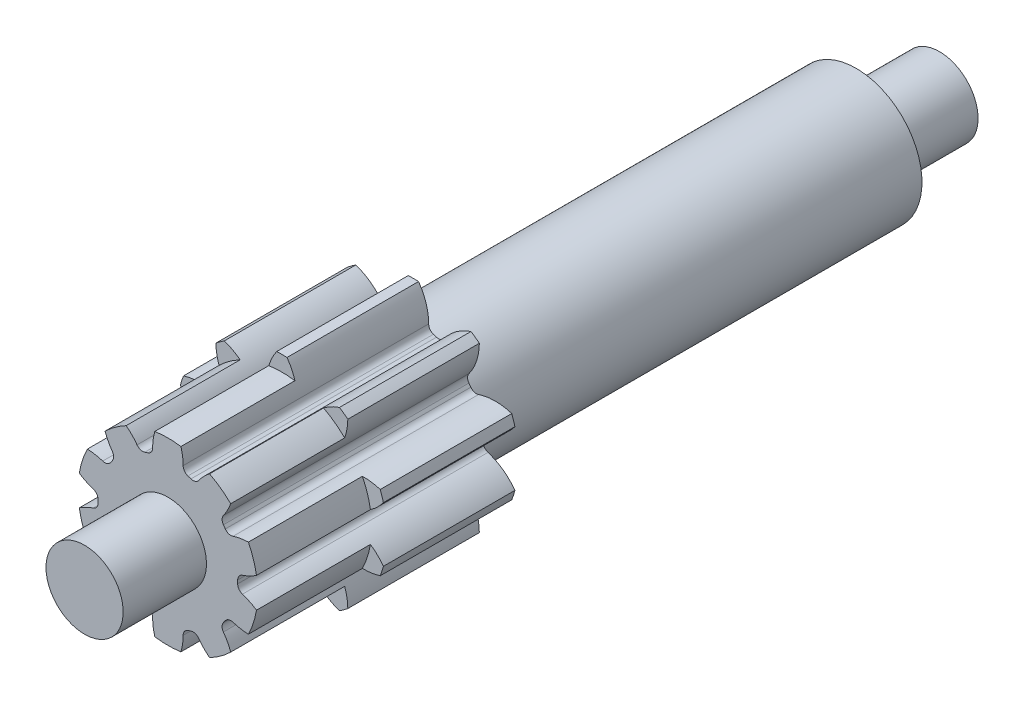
ISO-10303-21;
HEADER;
FILE_DESCRIPTION(('STEP AP214'),'2;1');
FILE_NAME('part.step','',(''),(''),'','','');
FILE_SCHEMA(('AUTOMOTIVE_DESIGN { 1 0 10303 214 1 1 1 1 }'));
ENDSEC;
DATA;
#1=APPLICATION_CONTEXT('core data for automotive mechanical design processes');
#2=APPLICATION_PROTOCOL_DEFINITION('international standard','automotive_design',2000,#1);
#3=PRODUCT_CONTEXT('',#1,'mechanical');
#4=PRODUCT('Part','Part','',(#3));
#5=PRODUCT_RELATED_PRODUCT_CATEGORY('part','',(#4));
#6=PRODUCT_DEFINITION_FORMATION('','',#4);
#7=PRODUCT_DEFINITION_CONTEXT('part definition',#1,'design');
#8=PRODUCT_DEFINITION('design','',#6,#7);
#9=PRODUCT_DEFINITION_SHAPE('','',#8);
#10=(LENGTH_UNIT() NAMED_UNIT(*) SI_UNIT(.MILLI.,.METRE.));
#11=(NAMED_UNIT(*) PLANE_ANGLE_UNIT() SI_UNIT($,.RADIAN.));
#12=(NAMED_UNIT(*) SI_UNIT($,.STERADIAN.) SOLID_ANGLE_UNIT());
#13=UNCERTAINTY_MEASURE_WITH_UNIT(LENGTH_MEASURE(1.E-05),#10,'distance_accuracy_value','');
#14=(GEOMETRIC_REPRESENTATION_CONTEXT(3) GLOBAL_UNCERTAINTY_ASSIGNED_CONTEXT((#13)) GLOBAL_UNIT_ASSIGNED_CONTEXT((#10,
#11,#12)) REPRESENTATION_CONTEXT('',''));
#15=CARTESIAN_POINT('',(0.,0.,0.));
#16=DIRECTION('',(0.,0.,1.));
#17=DIRECTION('',(1.,0.,0.));
#18=AXIS2_PLACEMENT_3D('',#15,#16,#17);
#19=CARTESIAN_POINT('',(-0.287943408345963,0.826129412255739,-4.875));
#20=DIRECTION('',(0.,0.,1.));
#21=DIRECTION('',(1.,0.,0.));
#22=AXIS2_PLACEMENT_3D('',#19,#20,#21);
#23=CYLINDRICAL_SURFACE('',#22,0.0785398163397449);
#24=DIRECTION('',(0.,0.,-1.));
#25=VECTOR('',#24,1.);
#26=CARTESIAN_POINT('',(-0.263673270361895,0.7514336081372,4.875));
#27=LINE('',#26,#25);
#28=CARTESIAN_POINT('',(-0.263673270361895,0.7514336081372,1.125));
#29=VERTEX_POINT('',#28);
#30=CARTESIAN_POINT('',(-0.263673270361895,0.7514336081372,3.925));
#31=VERTEX_POINT('',#30);
#32=EDGE_CURVE('E1081',#29,#31,#27,.F.);
#33=ORIENTED_EDGE('',*,*,#32,.F.);
#34=CARTESIAN_POINT('',(-0.287943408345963,0.826129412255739,1.125));
#35=DIRECTION('',(0.,0.,1.));
#36=DIRECTION('',(1.,0.,0.));
#37=AXIS2_PLACEMENT_3D('',#34,#35,#36);
#38=CIRCLE('',#37,0.0785398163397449);
#39=CARTESIAN_POINT('',(-0.351631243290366,0.780168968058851,1.125));
#40=VERTEX_POINT('',#39);
#41=EDGE_CURVE('E705',#29,#40,#38,.F.);
#42=ORIENTED_EDGE('',*,*,#41,.T.);
#43=DIRECTION('',(0.,0.,1.));
#44=VECTOR('',#43,1.);
#45=CARTESIAN_POINT('',(-0.351631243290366,0.780168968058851,-4.875));
#46=LINE('',#45,#44);
#47=CARTESIAN_POINT('',(-0.351631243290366,0.780168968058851,3.925));
#48=VERTEX_POINT('',#47);
#49=EDGE_CURVE('E1087',#48,#40,#46,.F.);
#50=ORIENTED_EDGE('',*,*,#49,.F.);
#51=CARTESIAN_POINT('',(-0.287943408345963,0.826129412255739,3.925));
#52=DIRECTION('',(0.,0.,-1.));
#53=DIRECTION('',(-1.,0.,0.));
#54=AXIS2_PLACEMENT_3D('',#51,#52,#53);
#55=CIRCLE('',#54,0.0785398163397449);
#56=EDGE_CURVE('E1311',#48,#31,#55,.F.);
#57=ORIENTED_EDGE('',*,*,#56,.T.);
#58=EDGE_LOOP('',(#33,#42,#50,#57));
#59=FACE_BOUND('',#58,.T.);
#60=ADVANCED_FACE('F38',(#59),#23,.F.);
#61=CARTESIAN_POINT('',(-0.252635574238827,0.837601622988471,-4.875));
#62=DIRECTION('',(0.,0.,1.));
#63=DIRECTION('',(1.,0.,0.));
#64=AXIS2_PLACEMENT_3D('',#61,#62,#63);
#65=CYLINDRICAL_SURFACE('',#64,0.0785398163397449);
#66=DIRECTION('',(0.,0.,1.));
#67=VECTOR('',#66,1.);
#68=CARTESIAN_POINT('',(-0.174096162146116,0.837853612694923,-4.875));
#69=LINE('',#68,#67);
#70=CARTESIAN_POINT('',(-0.174096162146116,0.837853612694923,1.125));
#71=VERTEX_POINT('',#70);
#72=CARTESIAN_POINT('',(-0.174096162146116,0.837853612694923,3.925));
#73=VERTEX_POINT('',#72);
#74=EDGE_CURVE('E1078',#71,#73,#69,.T.);
#75=ORIENTED_EDGE('',*,*,#74,.F.);
#76=CARTESIAN_POINT('',(-0.252635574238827,0.837601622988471,1.125));
#77=DIRECTION('',(0.,0.,1.));
#78=DIRECTION('',(1.,0.,0.));
#79=AXIS2_PLACEMENT_3D('',#76,#77,#78);
#80=CIRCLE('',#79,0.0785398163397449);
#81=CARTESIAN_POINT('',(-0.228365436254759,0.762905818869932,1.125));
#82=VERTEX_POINT('',#81);
#83=EDGE_CURVE('E696',#71,#82,#80,.F.);
#84=ORIENTED_EDGE('',*,*,#83,.T.);
#85=DIRECTION('',(0.,0.,-1.));
#86=VECTOR('',#85,1.);
#87=CARTESIAN_POINT('',(-0.228365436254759,0.762905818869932,-4.875));
#88=LINE('',#87,#86);
#89=CARTESIAN_POINT('',(-0.228365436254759,0.762905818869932,3.925));
#90=VERTEX_POINT('',#89);
#91=EDGE_CURVE('E1084',#90,#82,#88,.T.);
#92=ORIENTED_EDGE('',*,*,#91,.F.);
#93=CARTESIAN_POINT('',(-0.252635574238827,0.837601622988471,3.925));
#94=DIRECTION('',(0.,0.,-1.));
#95=DIRECTION('',(-1.,0.,0.));
#96=AXIS2_PLACEMENT_3D('',#93,#94,#95);
#97=CIRCLE('',#96,0.0785398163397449);
#98=EDGE_CURVE('E1321',#90,#73,#97,.F.);
#99=ORIENTED_EDGE('',*,*,#98,.T.);
#100=EDGE_LOOP('',(#75,#84,#92,#99));
#101=FACE_BOUND('',#100,.T.);
#102=ADVANCED_FACE('F1320',(#101),#65,.F.);
#103=CARTESIAN_POINT('',(-0.171323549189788,0.781439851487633,-4.875));
#104=DIRECTION('',(0.309016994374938,-0.951056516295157,0.));
#105=DIRECTION('',(0.951056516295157,0.309016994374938,0.));
#106=AXIS2_PLACEMENT_3D('',#103,#104,#105);
#107=PLANE('',#106);
#108=ORIENTED_EDGE('',*,*,#91,.T.);
#109=DIRECTION('',(-0.951056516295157,-0.309016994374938,0.));
#110=VECTOR('',#109,1.);
#111=CARTESIAN_POINT('',(-0.171323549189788,0.781439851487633,1.125));
#112=LINE('',#111,#110);
#113=EDGE_CURVE('E699',#82,#29,#112,.T.);
#114=ORIENTED_EDGE('',*,*,#113,.T.);
#115=ORIENTED_EDGE('',*,*,#32,.T.);
#116=DIRECTION('',(0.951056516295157,0.309016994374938,0.));
#117=VECTOR('',#116,1.);
#118=CARTESIAN_POINT('',(-0.171323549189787,0.781439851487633,3.925));
#119=LINE('',#118,#117);
#120=EDGE_CURVE('E1316',#31,#90,#119,.T.);
#121=ORIENTED_EDGE('',*,*,#120,.T.);
#122=EDGE_LOOP('',(#108,#114,#115,#121));
#123=FACE_BOUND('',#122,.T.);
#124=ADVANCED_FACE('F1313',(#123),#107,.F.);
#125=CARTESIAN_POINT('',(0.441389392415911,0.839828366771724,-4.875));
#126=DIRECTION('',(0.,0.,1.));
#127=DIRECTION('',(1.,0.,0.));
#128=AXIS2_PLACEMENT_3D('',#125,#126,#127);
#129=CYLINDRICAL_SURFACE('',#128,0.615488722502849);
#130=DIRECTION('',(0.,0.,1.));
#131=VECTOR('',#130,1.);
#132=CARTESIAN_POINT('',(-0.0587477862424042,1.19856109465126,-4.875));
#133=LINE('',#132,#131);
#134=CARTESIAN_POINT('',(-0.0587477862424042,1.19856109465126,1.125));
#135=VERTEX_POINT('',#134);
#136=CARTESIAN_POINT('',(-0.0587477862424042,1.19856109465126,2.625));
#137=VERTEX_POINT('',#136);
#138=EDGE_CURVE('E967',#135,#137,#133,.T.);
#139=ORIENTED_EDGE('',*,*,#138,.F.);
#140=CARTESIAN_POINT('',(0.441389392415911,0.839828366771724,1.125));
#141=DIRECTION('',(0.,0.,1.));
#142=DIRECTION('',(1.,0.,0.));
#143=AXIS2_PLACEMENT_3D('',#140,#141,#142);
#144=CIRCLE('',#143,0.615488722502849);
#145=EDGE_CURVE('E685',#135,#71,#144,.T.);
#146=ORIENTED_EDGE('',*,*,#145,.T.);
#147=ORIENTED_EDGE('',*,*,#74,.T.);
#148=CARTESIAN_POINT('',(0.441389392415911,0.839828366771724,3.925));
#149=DIRECTION('',(0.,0.,-1.));
#150=DIRECTION('',(-1.,0.,0.));
#151=AXIS2_PLACEMENT_3D('',#148,#149,#150);
#152=CIRCLE('',#151,0.615488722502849);
#153=CARTESIAN_POINT('',(-0.148904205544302,1.01412648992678,3.925));
#154=VERTEX_POINT('',#153);
#155=EDGE_CURVE('E1361',#73,#154,#152,.T.);
#156=ORIENTED_EDGE('',*,*,#155,.T.);
#157=DIRECTION('',(0.,0.,-1.));
#158=VECTOR('',#157,1.);
#159=CARTESIAN_POINT('',(-0.148904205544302,1.01412648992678,3.275));
#160=LINE('',#159,#158);
#161=CARTESIAN_POINT('',(-0.148904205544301,1.01412648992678,2.625));
#162=VERTEX_POINT('',#161);
#163=EDGE_CURVE('E899',#154,#162,#160,.T.);
#164=ORIENTED_EDGE('',*,*,#163,.T.);
#165=CARTESIAN_POINT('',(0.441389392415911,0.839828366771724,2.625));
#166=DIRECTION('',(0.,0.,-1.));
#167=DIRECTION('',(-1.,0.,0.));
#168=AXIS2_PLACEMENT_3D('',#165,#166,#167);
#169=CIRCLE('',#168,0.615488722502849);
#170=EDGE_CURVE('E819',#162,#137,#169,.T.);
#171=ORIENTED_EDGE('',*,*,#170,.T.);
#172=EDGE_LOOP('',(#139,#146,#147,#156,#164,#171));
#173=FACE_BOUND('',#172,.T.);
#174=ADVANCED_FACE('F1325',(#173),#129,.T.);
#175=CARTESIAN_POINT('',(-0.85073024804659,0.41999324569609,-4.875));
#176=DIRECTION('',(0.,0.,1.));
#177=DIRECTION('',(1.,0.,0.));
#178=AXIS2_PLACEMENT_3D('',#175,#176,#177);
#179=CYLINDRICAL_SURFACE('',#178,0.615488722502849);
#180=ORIENTED_EDGE('',*,*,#49,.T.);
#181=CARTESIAN_POINT('',(-0.85073024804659,0.41999324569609,1.125));
#182=DIRECTION('',(0.,0.,1.));
#183=DIRECTION('',(1.,0.,0.));
#184=AXIS2_PLACEMENT_3D('',#181,#182,#183);
#185=CIRCLE('',#184,0.615488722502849);
#186=CARTESIAN_POINT('',(-0.656968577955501,1.00418737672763,1.125));
#187=VERTEX_POINT('',#186);
#188=EDGE_CURVE('E711',#40,#187,#185,.T.);
#189=ORIENTED_EDGE('',*,*,#188,.T.);
#190=DIRECTION('',(0.,0.,1.));
#191=VECTOR('',#190,1.);
#192=CARTESIAN_POINT('',(-0.6569685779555,1.00418737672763,-4.875));
#193=LINE('',#192,#191);
#194=CARTESIAN_POINT('',(-0.6569685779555,1.00418737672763,2.625));
#195=VERTEX_POINT('',#194);
#196=EDGE_CURVE('E963',#187,#195,#193,.T.);
#197=ORIENTED_EDGE('',*,*,#196,.T.);
#198=CARTESIAN_POINT('',(-0.85073024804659,0.41999324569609,2.625));
#199=DIRECTION('',(0.,0.,-1.));
#200=DIRECTION('',(-1.,0.,0.));
#201=AXIS2_PLACEMENT_3D('',#198,#199,#200);
#202=CIRCLE('',#201,0.615488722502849);
#203=CARTESIAN_POINT('',(-0.475622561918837,0.907969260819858,2.625));
#204=VERTEX_POINT('',#203);
#205=EDGE_CURVE('E835',#195,#204,#202,.T.);
#206=ORIENTED_EDGE('',*,*,#205,.T.);
#207=DIRECTION('',(0.,0.,-1.));
#208=VECTOR('',#207,1.);
#209=CARTESIAN_POINT('',(-0.475622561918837,0.907969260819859,3.275));
#210=LINE('',#209,#208);
#211=CARTESIAN_POINT('',(-0.475622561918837,0.907969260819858,3.925));
#212=VERTEX_POINT('',#211);
#213=EDGE_CURVE('E902',#204,#212,#210,.F.);
#214=ORIENTED_EDGE('',*,*,#213,.T.);
#215=CARTESIAN_POINT('',(-0.85073024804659,0.41999324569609,3.925));
#216=DIRECTION('',(0.,0.,-1.));
#217=DIRECTION('',(-1.,0.,0.));
#218=AXIS2_PLACEMENT_3D('',#215,#216,#217);
#219=CIRCLE('',#218,0.615488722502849);
#220=EDGE_CURVE('E1307',#212,#48,#219,.T.);
#221=ORIENTED_EDGE('',*,*,#220,.T.);
#222=EDGE_LOOP('',(#180,#189,#197,#206,#214,#221));
#223=FACE_BOUND('',#222,.T.);
#224=ADVANCED_FACE('F1304',(#223),#179,.T.);
#225=CARTESIAN_POINT('',(-0.718537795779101,0.499103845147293,-4.875));
#226=DIRECTION('',(0.,0.,1.));
#227=DIRECTION('',(1.,0.,0.));
#228=AXIS2_PLACEMENT_3D('',#225,#226,#227);
#229=CYLINDRICAL_SURFACE('',#228,0.0785398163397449);
#230=DIRECTION('',(0.,0.,-1.));
#231=VECTOR('',#230,1.);
#232=CARTESIAN_POINT('',(-0.654997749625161,0.452939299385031,4.875));
#233=LINE('',#232,#231);
#234=CARTESIAN_POINT('',(-0.654997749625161,0.452939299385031,1.125));
#235=VERTEX_POINT('',#234);
#236=CARTESIAN_POINT('',(-0.654997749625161,0.452939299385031,3.925));
#237=VERTEX_POINT('',#236);
#238=EDGE_CURVE('E1069',#235,#237,#233,.F.);
#239=ORIENTED_EDGE('',*,*,#238,.F.);
#240=CARTESIAN_POINT('',(-0.718537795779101,0.499103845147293,1.125));
#241=DIRECTION('',(0.,0.,1.));
#242=DIRECTION('',(1.,0.,0.));
#243=AXIS2_PLACEMENT_3D('',#240,#241,#242);
#244=CIRCLE('',#243,0.0785398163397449);
#245=CARTESIAN_POINT('',(-0.743047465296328,0.424486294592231,1.125));
#246=VERTEX_POINT('',#245);
#247=EDGE_CURVE('E739',#235,#246,#244,.F.);
#248=ORIENTED_EDGE('',*,*,#247,.T.);
#249=DIRECTION('',(0.,0.,1.));
#250=VECTOR('',#249,1.);
#251=CARTESIAN_POINT('',(-0.743047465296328,0.424486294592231,-4.875));
#252=LINE('',#251,#250);
#253=CARTESIAN_POINT('',(-0.743047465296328,0.424486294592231,3.925));
#254=VERTEX_POINT('',#253);
#255=EDGE_CURVE('E1075',#254,#246,#252,.F.);
#256=ORIENTED_EDGE('',*,*,#255,.F.);
#257=CARTESIAN_POINT('',(-0.718537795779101,0.499103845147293,3.925));
#258=DIRECTION('',(0.,0.,-1.));
#259=DIRECTION('',(-1.,0.,0.));
#260=AXIS2_PLACEMENT_3D('',#257,#258,#259);
#261=CIRCLE('',#260,0.0785398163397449);
#262=EDGE_CURVE('E1283',#254,#237,#261,.F.);
#263=ORIENTED_EDGE('',*,*,#262,.T.);
#264=EDGE_LOOP('',(#239,#248,#256,#263));
#265=FACE_BOUND('',#264,.T.);
#266=ADVANCED_FACE('F1282',(#265),#229,.F.);
#267=CARTESIAN_POINT('',(-0.696716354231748,0.529138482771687,-4.875));
#268=DIRECTION('',(0.,0.,1.));
#269=DIRECTION('',(1.,0.,0.));
#270=AXIS2_PLACEMENT_3D('',#267,#268,#269);
#271=CYLINDRICAL_SURFACE('',#270,0.0785398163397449);
#272=DIRECTION('',(0.,0.,1.));
#273=VECTOR('',#272,1.);
#274=CARTESIAN_POINT('',(-0.63332475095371,0.575506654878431,-4.875));
#275=LINE('',#274,#273);
#276=CARTESIAN_POINT('',(-0.63332475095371,0.575506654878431,1.125));
#277=VERTEX_POINT('',#276);
#278=CARTESIAN_POINT('',(-0.63332475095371,0.575506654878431,3.925));
#279=VERTEX_POINT('',#278);
#280=EDGE_CURVE('E1066',#277,#279,#275,.T.);
#281=ORIENTED_EDGE('',*,*,#280,.F.);
#282=CARTESIAN_POINT('',(-0.696716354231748,0.529138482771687,1.125));
#283=DIRECTION('',(0.,0.,1.));
#284=DIRECTION('',(1.,0.,0.));
#285=AXIS2_PLACEMENT_3D('',#282,#283,#284);
#286=CIRCLE('',#285,0.0785398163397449);
#287=CARTESIAN_POINT('',(-0.633176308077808,0.482973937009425,1.125));
#288=VERTEX_POINT('',#287);
#289=EDGE_CURVE('E730',#277,#288,#286,.F.);
#290=ORIENTED_EDGE('',*,*,#289,.T.);
#291=DIRECTION('',(0.,0.,-1.));
#292=VECTOR('',#291,1.);
#293=CARTESIAN_POINT('',(-0.633176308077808,0.482973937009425,-4.875));
#294=LINE('',#293,#292);
#295=CARTESIAN_POINT('',(-0.633176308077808,0.482973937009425,3.925));
#296=VERTEX_POINT('',#295);
#297=EDGE_CURVE('E1072',#296,#288,#294,.T.);
#298=ORIENTED_EDGE('',*,*,#297,.F.);
#299=CARTESIAN_POINT('',(-0.696716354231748,0.529138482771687,3.925));
#300=DIRECTION('',(0.,0.,-1.));
#301=DIRECTION('',(-1.,0.,0.));
#302=AXIS2_PLACEMENT_3D('',#299,#300,#301);
#303=CIRCLE('',#302,0.0785398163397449);
#304=EDGE_CURVE('E1293',#296,#279,#303,.F.);
#305=ORIENTED_EDGE('',*,*,#304,.T.);
#306=EDGE_LOOP('',(#281,#290,#298,#305));
#307=FACE_BOUND('',#306,.T.);
#308=ADVANCED_FACE('F1292',(#307),#271,.F.);
#309=CARTESIAN_POINT('',(-0.597922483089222,0.531496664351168,-4.875));
#310=DIRECTION('',(0.809016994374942,-0.58778525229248,0.));
#311=DIRECTION('',(0.58778525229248,0.809016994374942,0.));
#312=AXIS2_PLACEMENT_3D('',#309,#310,#311);
#313=PLANE('',#312);
#314=ORIENTED_EDGE('',*,*,#297,.T.);
#315=DIRECTION('',(-0.58778525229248,-0.809016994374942,0.));
#316=VECTOR('',#315,1.);
#317=CARTESIAN_POINT('',(-0.597922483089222,0.531496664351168,1.125));
#318=LINE('',#317,#316);
#319=EDGE_CURVE('E733',#288,#235,#318,.T.);
#320=ORIENTED_EDGE('',*,*,#319,.T.);
#321=ORIENTED_EDGE('',*,*,#238,.T.);
#322=DIRECTION('',(0.58778525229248,0.809016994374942,0.));
#323=VECTOR('',#322,1.);
#324=CARTESIAN_POINT('',(-0.597922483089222,0.531496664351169,3.925));
#325=LINE('',#324,#323);
#326=EDGE_CURVE('E1288',#237,#296,#325,.T.);
#327=ORIENTED_EDGE('',*,*,#326,.T.);
#328=EDGE_LOOP('',(#314,#320,#321,#327));
#329=FACE_BOUND('',#328,.T.);
#330=ADVANCED_FACE('F1285',(#329),#313,.F.);
#331=CARTESIAN_POINT('',(-0.13654720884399,0.938877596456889,-4.875));
#332=DIRECTION('',(0.,0.,1.));
#333=DIRECTION('',(1.,0.,0.));
#334=AXIS2_PLACEMENT_3D('',#331,#332,#333);
#335=CYLINDRICAL_SURFACE('',#334,0.615488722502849);
#336=DIRECTION('',(0.,0.,1.));
#337=VECTOR('',#336,1.);
#338=CARTESIAN_POINT('',(-0.752024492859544,0.93512521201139,-4.875));
#339=LINE('',#338,#337);
#340=CARTESIAN_POINT('',(-0.752024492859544,0.935125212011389,1.125));
#341=VERTEX_POINT('',#340);
#342=CARTESIAN_POINT('',(-0.752024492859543,0.93512521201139,2.625));
#343=VERTEX_POINT('',#342);
#344=EDGE_CURVE('E966',#341,#343,#339,.T.);
#345=ORIENTED_EDGE('',*,*,#344,.F.);
#346=CARTESIAN_POINT('',(-0.13654720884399,0.938877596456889,1.125));
#347=DIRECTION('',(0.,0.,1.));
#348=DIRECTION('',(1.,0.,0.));
#349=AXIS2_PLACEMENT_3D('',#346,#347,#348);
#350=CIRCLE('',#349,0.615488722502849);
#351=EDGE_CURVE('E722',#341,#277,#350,.T.);
#352=ORIENTED_EDGE('',*,*,#351,.T.);
#353=ORIENTED_EDGE('',*,*,#280,.T.);
#354=CARTESIAN_POINT('',(-0.13654720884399,0.938877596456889,3.925));
#355=DIRECTION('',(0.,0.,-1.));
#356=DIRECTION('',(-1.,0.,0.));
#357=AXIS2_PLACEMENT_3D('',#354,#355,#356);
#358=CIRCLE('',#357,0.615488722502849);
#359=CARTESIAN_POINT('',(-0.716554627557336,0.732921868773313,3.925));
#360=VERTEX_POINT('',#359);
#361=EDGE_CURVE('E1367',#279,#360,#358,.T.);
#362=ORIENTED_EDGE('',*,*,#361,.T.);
#363=DIRECTION('',(0.,0.,-1.));
#364=VECTOR('',#363,1.);
#365=CARTESIAN_POINT('',(-0.716554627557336,0.732921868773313,3.275));
#366=LINE('',#365,#364);
#367=CARTESIAN_POINT('',(-0.716554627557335,0.732921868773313,2.625));
#368=VERTEX_POINT('',#367);
#369=EDGE_CURVE('E894',#360,#368,#366,.T.);
#370=ORIENTED_EDGE('',*,*,#369,.T.);
#371=CARTESIAN_POINT('',(-0.13654720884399,0.938877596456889,2.625));
#372=DIRECTION('',(0.,0.,-1.));
#373=DIRECTION('',(-1.,0.,0.));
#374=AXIS2_PLACEMENT_3D('',#371,#372,#373);
#375=CIRCLE('',#374,0.615488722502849);
#376=EDGE_CURVE('E830',#368,#343,#375,.T.);
#377=ORIENTED_EDGE('',*,*,#376,.T.);
#378=EDGE_LOOP('',(#345,#352,#353,#362,#370,#377));
#379=FACE_BOUND('',#378,.T.);
#380=ADVANCED_FACE('F1297',(#379),#335,.T.);
#381=CARTESIAN_POINT('',(-0.935121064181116,-0.160265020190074,-4.875));
#382=DIRECTION('',(0.,0.,1.));
#383=DIRECTION('',(1.,0.,0.));
#384=AXIS2_PLACEMENT_3D('',#381,#382,#383);
#385=CYLINDRICAL_SURFACE('',#384,0.615488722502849);
#386=ORIENTED_EDGE('',*,*,#255,.T.);
#387=CARTESIAN_POINT('',(-0.935121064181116,-0.160265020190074,1.125));
#388=DIRECTION('',(0.,0.,1.));
#389=DIRECTION('',(1.,0.,0.));
#390=AXIS2_PLACEMENT_3D('',#387,#388,#389);
#391=CIRCLE('',#390,0.615488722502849);
#392=CARTESIAN_POINT('',(-1.12174527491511,0.426248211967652,1.125));
#393=VERTEX_POINT('',#392);
#394=EDGE_CURVE('E745',#246,#393,#391,.T.);
#395=ORIENTED_EDGE('',*,*,#394,.T.);
#396=DIRECTION('',(0.,0.,1.));
#397=VECTOR('',#396,1.);
#398=CARTESIAN_POINT('',(-1.12174527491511,0.426248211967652,-4.875));
#399=LINE('',#398,#397);
#400=CARTESIAN_POINT('',(-1.12174527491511,0.426248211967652,2.625));
#401=VERTEX_POINT('',#400);
#402=EDGE_CURVE('E950',#393,#401,#399,.T.);
#403=ORIENTED_EDGE('',*,*,#402,.T.);
#404=CARTESIAN_POINT('',(-0.935121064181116,-0.160265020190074,2.625));
#405=DIRECTION('',(0.,0.,-1.));
#406=DIRECTION('',(-1.,0.,0.));
#407=AXIS2_PLACEMENT_3D('',#404,#405,#406);
#408=CIRCLE('',#407,0.615488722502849);
#409=CARTESIAN_POINT('',(-0.9184776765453,0.454998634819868,2.625));
#410=VERTEX_POINT('',#409);
#411=EDGE_CURVE('E838',#401,#410,#408,.T.);
#412=ORIENTED_EDGE('',*,*,#411,.T.);
#413=DIRECTION('',(0.,0.,-1.));
#414=VECTOR('',#413,1.);
#415=CARTESIAN_POINT('',(-0.918477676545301,0.454998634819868,3.275));
#416=LINE('',#415,#414);
#417=CARTESIAN_POINT('',(-0.9184776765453,0.454998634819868,3.925));
#418=VERTEX_POINT('',#417);
#419=EDGE_CURVE('E897',#410,#418,#416,.F.);
#420=ORIENTED_EDGE('',*,*,#419,.T.);
#421=CARTESIAN_POINT('',(-0.935121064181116,-0.160265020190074,3.925));
#422=DIRECTION('',(0.,0.,-1.));
#423=DIRECTION('',(-1.,0.,0.));
#424=AXIS2_PLACEMENT_3D('',#421,#422,#423);
#425=CIRCLE('',#424,0.615488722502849);
#426=EDGE_CURVE('E553',#418,#254,#425,.T.);
#427=ORIENTED_EDGE('',*,*,#426,.T.);
#428=EDGE_LOOP('',(#386,#395,#403,#412,#420,#427));
#429=FACE_BOUND('',#428,.T.);
#430=ADVANCED_FACE('F1277',(#429),#385,.T.);
#431=CARTESIAN_POINT('',(0.,0.,-4.875));
#432=DIRECTION('',(0.,0.,1.));
#433=DIRECTION('',(1.,0.,0.));
#434=AXIS2_PLACEMENT_3D('',#431,#432,#433);
#435=CYLINDRICAL_SURFACE('',#434,1.2);
#436=CARTESIAN_POINT('',(0.,0.,1.125));
#437=DIRECTION('',(0.,0.,1.));
#438=DIRECTION('',(1.,0.,0.));
#439=AXIS2_PLACEMENT_3D('',#436,#437,#438);
#440=CIRCLE('',#439,1.2);
#441=EDGE_CURVE('E717',#341,#187,#440,.F.);
#442=ORIENTED_EDGE('',*,*,#441,.F.);
#443=ORIENTED_EDGE('',*,*,#344,.T.);
#444=CARTESIAN_POINT('',(0.,0.,2.625));
#445=DIRECTION('',(0.,0.,-1.));
#446=DIRECTION('',(-1.,0.,0.));
#447=AXIS2_PLACEMENT_3D('',#444,#445,#446);
#448=CIRCLE('',#447,1.2);
#449=EDGE_CURVE('E833',#195,#343,#448,.F.);
#450=ORIENTED_EDGE('',*,*,#449,.F.);
#451=ORIENTED_EDGE('',*,*,#196,.F.);
#452=EDGE_LOOP('',(#442,#443,#450,#451));
#453=FACE_BOUND('',#452,.T.);
#454=ADVANCED_FACE('F1301',(#453),#435,.T.);
#455=CARTESIAN_POINT('',(-0.874675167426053,-0.0185624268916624,-4.875));
#456=DIRECTION('',(0.,0.,1.));
#457=DIRECTION('',(1.,0.,0.));
#458=AXIS2_PLACEMENT_3D('',#455,#456,#457);
#459=CYLINDRICAL_SURFACE('',#458,0.0785398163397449);
#460=DIRECTION('',(0.,0.,-1.));
#461=VECTOR('',#460,1.);
#462=CARTESIAN_POINT('',(-0.796135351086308,-0.0185624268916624,4.875));
#463=LINE('',#462,#461);
#464=CARTESIAN_POINT('',(-0.796135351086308,-0.0185624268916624,1.125));
#465=VERTEX_POINT('',#464);
#466=CARTESIAN_POINT('',(-0.796135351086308,-0.0185624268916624,3.925));
#467=VERTEX_POINT('',#466);
#468=EDGE_CURVE('E1057',#465,#467,#463,.F.);
#469=ORIENTED_EDGE('',*,*,#468,.F.);
#470=CARTESIAN_POINT('',(-0.874675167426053,-0.0185624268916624,1.125));
#471=DIRECTION('',(0.,0.,1.));
#472=DIRECTION('',(1.,0.,0.));
#473=AXIS2_PLACEMENT_3D('',#470,#471,#472);
#474=CIRCLE('',#473,0.0785398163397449);
#475=CARTESIAN_POINT('',(-0.850644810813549,-0.0933357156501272,1.125));
#476=VERTEX_POINT('',#475);
#477=EDGE_CURVE('E772',#465,#476,#474,.F.);
#478=ORIENTED_EDGE('',*,*,#477,.T.);
#479=DIRECTION('',(0.,0.,1.));
#480=VECTOR('',#479,1.);
#481=CARTESIAN_POINT('',(-0.850644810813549,-0.0933357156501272,-4.875));
#482=LINE('',#481,#480);
#483=CARTESIAN_POINT('',(-0.850644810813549,-0.0933357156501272,3.925));
#484=VERTEX_POINT('',#483);
#485=EDGE_CURVE('E1063',#484,#476,#482,.F.);
#486=ORIENTED_EDGE('',*,*,#485,.F.);
#487=CARTESIAN_POINT('',(-0.874675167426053,-0.0185624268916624,3.925));
#488=DIRECTION('',(0.,0.,-1.));
#489=DIRECTION('',(-1.,0.,0.));
#490=AXIS2_PLACEMENT_3D('',#487,#488,#489);
#491=CIRCLE('',#490,0.0785398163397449);
#492=EDGE_CURVE('E1263',#484,#467,#491,.F.);
#493=ORIENTED_EDGE('',*,*,#492,.T.);
#494=EDGE_LOOP('',(#469,#478,#486,#493));
#495=FACE_BOUND('',#494,.T.);
#496=ADVANCED_FACE('F1262',(#495),#459,.F.);
#497=CARTESIAN_POINT('',(-0.874675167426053,0.0185624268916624,-4.875));
#498=DIRECTION('',(0.,0.,1.));
#499=DIRECTION('',(1.,0.,0.));
#500=AXIS2_PLACEMENT_3D('',#497,#498,#499);
#501=CYLINDRICAL_SURFACE('',#500,0.0785398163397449);
#502=DIRECTION('',(0.,0.,1.));
#503=VECTOR('',#502,1.);
#504=CARTESIAN_POINT('',(-0.850644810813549,0.0933357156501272,-4.875));
#505=LINE('',#504,#503);
#506=CARTESIAN_POINT('',(-0.850644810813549,0.0933357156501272,1.125));
#507=VERTEX_POINT('',#506);
#508=CARTESIAN_POINT('',(-0.850644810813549,0.0933357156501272,3.925));
#509=VERTEX_POINT('',#508);
#510=EDGE_CURVE('E563',#507,#509,#505,.T.);
#511=ORIENTED_EDGE('',*,*,#510,.F.);
#512=CARTESIAN_POINT('',(-0.874675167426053,0.0185624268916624,1.125));
#513=DIRECTION('',(0.,0.,1.));
#514=DIRECTION('',(1.,0.,0.));
#515=AXIS2_PLACEMENT_3D('',#512,#513,#514);
#516=CIRCLE('',#515,0.0785398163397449);
#517=CARTESIAN_POINT('',(-0.796135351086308,0.0185624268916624,1.125));
#518=VERTEX_POINT('',#517);
#519=EDGE_CURVE('E763',#507,#518,#516,.F.);
#520=ORIENTED_EDGE('',*,*,#519,.T.);
#521=DIRECTION('',(0.,0.,-1.));
#522=VECTOR('',#521,1.);
#523=CARTESIAN_POINT('',(-0.796135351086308,0.0185624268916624,-4.875));
#524=LINE('',#523,#522);
#525=CARTESIAN_POINT('',(-0.796135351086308,0.0185624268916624,3.925));
#526=VERTEX_POINT('',#525);
#527=EDGE_CURVE('E1060',#526,#518,#524,.T.);
#528=ORIENTED_EDGE('',*,*,#527,.F.);
#529=CARTESIAN_POINT('',(-0.874675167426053,0.0185624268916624,3.925));
#530=DIRECTION('',(0.,0.,-1.));
#531=DIRECTION('',(-1.,0.,0.));
#532=AXIS2_PLACEMENT_3D('',#529,#530,#531);
#533=CIRCLE('',#532,0.0785398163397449);
#534=EDGE_CURVE('E565',#526,#509,#533,.F.);
#535=ORIENTED_EDGE('',*,*,#534,.T.);
#536=EDGE_LOOP('',(#511,#520,#528,#535));
#537=FACE_BOUND('',#536,.T.);
#538=ADVANCED_FACE('F1270',(#537),#501,.F.);
#539=CARTESIAN_POINT('',(-0.796135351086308,0.0785398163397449,-4.875));
#540=DIRECTION('',(1.,0.,0.));
#541=DIRECTION('',(0.,0.,-1.));
#542=AXIS2_PLACEMENT_3D('',#539,#540,#541);
#543=PLANE('',#542);
#544=ORIENTED_EDGE('',*,*,#527,.T.);
#545=DIRECTION('',(0.,-1.,0.));
#546=VECTOR('',#545,1.);
#547=CARTESIAN_POINT('',(-0.796135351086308,0.0785398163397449,1.125));
#548=LINE('',#547,#546);
#549=EDGE_CURVE('E769',#518,#465,#548,.T.);
#550=ORIENTED_EDGE('',*,*,#549,.T.);
#551=ORIENTED_EDGE('',*,*,#468,.T.);
#552=DIRECTION('',(0.,1.,0.));
#553=VECTOR('',#552,1.);
#554=CARTESIAN_POINT('',(-0.796135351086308,0.0785398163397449,3.925));
#555=LINE('',#554,#553);
#556=EDGE_CURVE('E1268',#467,#526,#555,.T.);
#557=ORIENTED_EDGE('',*,*,#556,.T.);
#558=EDGE_LOOP('',(#544,#550,#551,#557));
#559=FACE_BOUND('',#558,.T.);
#560=ADVANCED_FACE('F1265',(#559),#543,.F.);
#561=CARTESIAN_POINT('',(-0.662327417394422,0.679307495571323,-4.875));
#562=DIRECTION('',(0.,0.,1.));
#563=DIRECTION('',(1.,0.,0.));
#564=AXIS2_PLACEMENT_3D('',#561,#562,#563);
#565=CYLINDRICAL_SURFACE('',#564,0.615488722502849);
#566=DIRECTION('',(0.,0.,1.));
#567=VECTOR('',#566,1.);
#568=CARTESIAN_POINT('',(-1.15805340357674,0.314503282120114,-4.875));
#569=LINE('',#568,#567);
#570=CARTESIAN_POINT('',(-1.15805340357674,0.314503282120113,1.125));
#571=VERTEX_POINT('',#570);
#572=CARTESIAN_POINT('',(-1.15805340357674,0.314503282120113,2.625));
#573=VERTEX_POINT('',#572);
#574=EDGE_CURVE('E947',#571,#573,#569,.T.);
#575=ORIENTED_EDGE('',*,*,#574,.F.);
#576=CARTESIAN_POINT('',(-0.662327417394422,0.679307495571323,1.125));
#577=DIRECTION('',(0.,0.,1.));
#578=DIRECTION('',(1.,0.,0.));
#579=AXIS2_PLACEMENT_3D('',#576,#577,#578);
#580=CIRCLE('',#579,0.615488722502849);
#581=EDGE_CURVE('E759',#571,#507,#580,.T.);
#582=ORIENTED_EDGE('',*,*,#581,.T.);
#583=ORIENTED_EDGE('',*,*,#510,.T.);
#584=CARTESIAN_POINT('',(-0.662327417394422,0.679307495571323,3.925));
#585=DIRECTION('',(0.,0.,-1.));
#586=DIRECTION('',(-1.,0.,0.));
#587=AXIS2_PLACEMENT_3D('',#584,#585,#586);
#588=CIRCLE('',#587,0.615488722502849);
#589=CARTESIAN_POINT('',(-1.01050553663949,0.171766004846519,3.925));
#590=VERTEX_POINT('',#589);
#591=EDGE_CURVE('E550',#509,#590,#588,.T.);
#592=ORIENTED_EDGE('',*,*,#591,.T.);
#593=DIRECTION('',(0.,0.,-1.));
#594=VECTOR('',#593,1.);
#595=CARTESIAN_POINT('',(-1.01050553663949,0.171766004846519,3.275));
#596=LINE('',#595,#594);
#597=CARTESIAN_POINT('',(-1.01050553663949,0.171766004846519,2.625));
#598=VERTEX_POINT('',#597);
#599=EDGE_CURVE('E536',#590,#598,#596,.T.);
#600=ORIENTED_EDGE('',*,*,#599,.T.);
#601=CARTESIAN_POINT('',(-0.662327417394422,0.679307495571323,2.625));
#602=DIRECTION('',(0.,0.,-1.));
#603=DIRECTION('',(-1.,0.,0.));
#604=AXIS2_PLACEMENT_3D('',#601,#602,#603);
#605=CIRCLE('',#604,0.615488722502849);
#606=EDGE_CURVE('E843',#598,#573,#605,.T.);
#607=ORIENTED_EDGE('',*,*,#606,.T.);
#608=EDGE_LOOP('',(#575,#582,#583,#592,#600,#607));
#609=FACE_BOUND('',#608,.T.);
#610=ADVANCED_FACE('F560',(#609),#565,.T.);
#611=CARTESIAN_POINT('',(-0.662327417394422,-0.679307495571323,-4.875));
#612=DIRECTION('',(0.,0.,1.));
#613=DIRECTION('',(1.,0.,0.));
#614=AXIS2_PLACEMENT_3D('',#611,#612,#613);
#615=CYLINDRICAL_SURFACE('',#614,0.615488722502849);
#616=ORIENTED_EDGE('',*,*,#485,.T.);
#617=CARTESIAN_POINT('',(-0.662327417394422,-0.679307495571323,1.125));
#618=DIRECTION('',(0.,0.,1.));
#619=DIRECTION('',(1.,0.,0.));
#620=AXIS2_PLACEMENT_3D('',#617,#618,#619);
#621=CIRCLE('',#620,0.615488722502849);
#622=CARTESIAN_POINT('',(-1.15805340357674,-0.314503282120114,1.125));
#623=VERTEX_POINT('',#622);
#624=EDGE_CURVE('E781',#476,#623,#621,.T.);
#625=ORIENTED_EDGE('',*,*,#624,.T.);
#626=DIRECTION('',(0.,0.,1.));
#627=VECTOR('',#626,1.);
#628=CARTESIAN_POINT('',(-1.15805340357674,-0.314503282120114,-4.875));
#629=LINE('',#628,#627);
#630=CARTESIAN_POINT('',(-1.15805340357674,-0.314503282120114,2.625));
#631=VERTEX_POINT('',#630);
#632=EDGE_CURVE('E944',#623,#631,#629,.T.);
#633=ORIENTED_EDGE('',*,*,#632,.T.);
#634=CARTESIAN_POINT('',(-0.662327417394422,-0.679307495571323,2.625));
#635=DIRECTION('',(0.,0.,-1.));
#636=DIRECTION('',(-1.,0.,0.));
#637=AXIS2_PLACEMENT_3D('',#634,#635,#636);
#638=CIRCLE('',#637,0.615488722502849);
#639=CARTESIAN_POINT('',(-1.01050553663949,-0.171766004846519,2.625));
#640=VERTEX_POINT('',#639);
#641=EDGE_CURVE('E874',#631,#640,#638,.T.);
#642=ORIENTED_EDGE('',*,*,#641,.T.);
#643=DIRECTION('',(0.,0.,-1.));
#644=VECTOR('',#643,1.);
#645=CARTESIAN_POINT('',(-1.01050553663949,-0.171766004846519,3.275));
#646=LINE('',#645,#644);
#647=CARTESIAN_POINT('',(-1.01050553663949,-0.171766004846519,3.925));
#648=VERTEX_POINT('',#647);
#649=EDGE_CURVE('E546',#640,#648,#646,.F.);
#650=ORIENTED_EDGE('',*,*,#649,.T.);
#651=CARTESIAN_POINT('',(-0.662327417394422,-0.679307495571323,3.925));
#652=DIRECTION('',(0.,0.,-1.));
#653=DIRECTION('',(-1.,0.,0.));
#654=AXIS2_PLACEMENT_3D('',#651,#652,#653);
#655=CIRCLE('',#654,0.615488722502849);
#656=EDGE_CURVE('E570',#648,#484,#655,.T.);
#657=ORIENTED_EDGE('',*,*,#656,.T.);
#658=EDGE_LOOP('',(#616,#625,#633,#642,#650,#657));
#659=FACE_BOUND('',#658,.T.);
#660=ADVANCED_FACE('F1256',(#659),#615,.T.);
#661=CARTESIAN_POINT('',(-0.696716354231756,-0.529138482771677,-4.875));
#662=DIRECTION('',(0.,0.,1.));
#663=DIRECTION('',(1.,0.,0.));
#664=AXIS2_PLACEMENT_3D('',#661,#662,#663);
#665=CYLINDRICAL_SURFACE('',#664,0.0785398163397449);
#666=DIRECTION('',(0.,0.,-1.));
#667=VECTOR('',#666,1.);
#668=CARTESIAN_POINT('',(-0.633176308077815,-0.482973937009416,4.875));
#669=LINE('',#668,#667);
#670=CARTESIAN_POINT('',(-0.633176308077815,-0.482973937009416,1.125));
#671=VERTEX_POINT('',#670);
#672=CARTESIAN_POINT('',(-0.633176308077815,-0.482973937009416,3.925));
#673=VERTEX_POINT('',#672);
#674=EDGE_CURVE('E1047',#671,#673,#669,.F.);
#675=ORIENTED_EDGE('',*,*,#674,.F.);
#676=CARTESIAN_POINT('',(-0.696716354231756,-0.529138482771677,1.125));
#677=DIRECTION('',(0.,0.,1.));
#678=DIRECTION('',(1.,0.,0.));
#679=AXIS2_PLACEMENT_3D('',#676,#677,#678);
#680=CIRCLE('',#679,0.0785398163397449);
#681=CARTESIAN_POINT('',(-0.633324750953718,-0.575506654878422,1.125));
#682=VERTEX_POINT('',#681);
#683=EDGE_CURVE('E806',#671,#682,#680,.F.);
#684=ORIENTED_EDGE('',*,*,#683,.T.);
#685=DIRECTION('',(0.,0.,1.));
#686=VECTOR('',#685,1.);
#687=CARTESIAN_POINT('',(-0.633324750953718,-0.575506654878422,-4.875));
#688=LINE('',#687,#686);
#689=CARTESIAN_POINT('',(-0.633324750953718,-0.575506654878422,3.925));
#690=VERTEX_POINT('',#689);
#691=EDGE_CURVE('E1053',#690,#682,#688,.F.);
#692=ORIENTED_EDGE('',*,*,#691,.F.);
#693=CARTESIAN_POINT('',(-0.696716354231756,-0.529138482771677,3.925));
#694=DIRECTION('',(0.,0.,-1.));
#695=DIRECTION('',(-1.,0.,0.));
#696=AXIS2_PLACEMENT_3D('',#693,#694,#695);
#697=CIRCLE('',#696,0.0785398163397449);
#698=EDGE_CURVE('E564',#690,#673,#697,.F.);
#699=ORIENTED_EDGE('',*,*,#698,.T.);
#700=EDGE_LOOP('',(#675,#684,#692,#699));
#701=FACE_BOUND('',#700,.T.);
#702=ADVANCED_FACE('F1240',(#701),#665,.F.);
#703=CARTESIAN_POINT('',(-0.718537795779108,-0.499103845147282,-4.875));
#704=DIRECTION('',(0.,0.,1.));
#705=DIRECTION('',(1.,0.,0.));
#706=AXIS2_PLACEMENT_3D('',#703,#704,#705);
#707=CYLINDRICAL_SURFACE('',#706,0.0785398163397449);
#708=DIRECTION('',(0.,0.,1.));
#709=VECTOR('',#708,1.);
#710=CARTESIAN_POINT('',(-0.743047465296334,-0.42448629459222,-4.875));
#711=LINE('',#710,#709);
#712=CARTESIAN_POINT('',(-0.743047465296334,-0.42448629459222,1.125));
#713=VERTEX_POINT('',#712);
#714=CARTESIAN_POINT('',(-0.743047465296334,-0.42448629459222,3.925));
#715=VERTEX_POINT('',#714);
#716=EDGE_CURVE('E1044',#713,#715,#711,.T.);
#717=ORIENTED_EDGE('',*,*,#716,.F.);
#718=CARTESIAN_POINT('',(-0.718537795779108,-0.499103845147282,1.125));
#719=DIRECTION('',(0.,0.,1.));
#720=DIRECTION('',(1.,0.,0.));
#721=AXIS2_PLACEMENT_3D('',#718,#719,#720);
#722=CIRCLE('',#721,0.0785398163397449);
#723=CARTESIAN_POINT('',(-0.654997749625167,-0.452939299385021,1.125));
#724=VERTEX_POINT('',#723);
#725=EDGE_CURVE('E797',#713,#724,#722,.F.);
#726=ORIENTED_EDGE('',*,*,#725,.T.);
#727=DIRECTION('',(0.,0.,-1.));
#728=VECTOR('',#727,1.);
#729=CARTESIAN_POINT('',(-0.654997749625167,-0.452939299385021,-4.875));
#730=LINE('',#729,#728);
#731=CARTESIAN_POINT('',(-0.654997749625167,-0.452939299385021,3.925));
#732=VERTEX_POINT('',#731);
#733=EDGE_CURVE('E1050',#732,#724,#730,.T.);
#734=ORIENTED_EDGE('',*,*,#733,.F.);
#735=CARTESIAN_POINT('',(-0.718537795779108,-0.499103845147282,3.925));
#736=DIRECTION('',(0.,0.,-1.));
#737=DIRECTION('',(-1.,0.,0.));
#738=AXIS2_PLACEMENT_3D('',#735,#736,#737);
#739=CIRCLE('',#738,0.0785398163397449);
#740=EDGE_CURVE('E579',#732,#715,#739,.F.);
#741=ORIENTED_EDGE('',*,*,#740,.T.);
#742=EDGE_LOOP('',(#717,#726,#734,#741));
#743=FACE_BOUND('',#742,.T.);
#744=ADVANCED_FACE('F1246',(#743),#707,.F.);
#745=CARTESIAN_POINT('',(-0.690251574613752,-0.404416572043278,-4.875));
#746=DIRECTION('',(0.809016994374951,0.587785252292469,0.));
#747=DIRECTION('',(-0.587785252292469,0.809016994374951,0.));
#748=AXIS2_PLACEMENT_3D('',#745,#746,#747);
#749=PLANE('',#748);
#750=ORIENTED_EDGE('',*,*,#733,.T.);
#751=DIRECTION('',(0.587785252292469,-0.809016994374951,0.));
#752=VECTOR('',#751,1.);
#753=CARTESIAN_POINT('',(-0.690251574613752,-0.404416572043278,1.125));
#754=LINE('',#753,#752);
#755=EDGE_CURVE('E800',#724,#671,#754,.T.);
#756=ORIENTED_EDGE('',*,*,#755,.T.);
#757=ORIENTED_EDGE('',*,*,#674,.T.);
#758=DIRECTION('',(-0.587785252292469,0.809016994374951,0.));
#759=VECTOR('',#758,1.);
#760=CARTESIAN_POINT('',(-0.690251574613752,-0.404416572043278,3.925));
#761=LINE('',#760,#759);
#762=EDGE_CURVE('E568',#673,#732,#761,.T.);
#763=ORIENTED_EDGE('',*,*,#762,.T.);
#764=EDGE_LOOP('',(#750,#756,#757,#763));
#765=FACE_BOUND('',#764,.T.);
#766=ADVANCED_FACE('F1242',(#765),#749,.F.);
#767=CARTESIAN_POINT('',(-0.935121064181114,0.160265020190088,-4.875));
#768=DIRECTION('',(0.,0.,1.));
#769=DIRECTION('',(1.,0.,0.));
#770=AXIS2_PLACEMENT_3D('',#767,#768,#769);
#771=CYLINDRICAL_SURFACE('',#770,0.615488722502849);
#772=DIRECTION('',(0.,0.,1.));
#773=VECTOR('',#772,1.);
#774=CARTESIAN_POINT('',(-1.12174527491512,-0.426248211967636,-4.875));
#775=LINE('',#774,#773);
#776=CARTESIAN_POINT('',(-1.12174527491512,-0.426248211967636,1.125));
#777=VERTEX_POINT('',#776);
#778=CARTESIAN_POINT('',(-1.12174527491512,-0.426248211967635,2.625));
#779=VERTEX_POINT('',#778);
#780=EDGE_CURVE('E941',#777,#779,#775,.T.);
#781=ORIENTED_EDGE('',*,*,#780,.F.);
#782=CARTESIAN_POINT('',(-0.935121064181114,0.160265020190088,1.125));
#783=DIRECTION('',(0.,0.,1.));
#784=DIRECTION('',(1.,0.,0.));
#785=AXIS2_PLACEMENT_3D('',#782,#783,#784);
#786=CIRCLE('',#785,0.615488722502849);
#787=EDGE_CURVE('E792',#777,#713,#786,.T.);
#788=ORIENTED_EDGE('',*,*,#787,.T.);
#789=ORIENTED_EDGE('',*,*,#716,.T.);
#790=CARTESIAN_POINT('',(-0.935121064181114,0.160265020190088,3.925));
#791=DIRECTION('',(0.,0.,-1.));
#792=DIRECTION('',(-1.,0.,0.));
#793=AXIS2_PLACEMENT_3D('',#790,#791,#792);
#794=CIRCLE('',#793,0.615488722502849);
#795=CARTESIAN_POINT('',(-0.918477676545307,-0.454998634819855,3.925));
#796=VERTEX_POINT('',#795);
#797=EDGE_CURVE('E582',#715,#796,#794,.T.);
#798=ORIENTED_EDGE('',*,*,#797,.T.);
#799=DIRECTION('',(0.,0.,-1.));
#800=VECTOR('',#799,1.);
#801=CARTESIAN_POINT('',(-0.918477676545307,-0.454998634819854,3.275));
#802=LINE('',#801,#800);
#803=CARTESIAN_POINT('',(-0.918477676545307,-0.454998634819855,2.625));
#804=VERTEX_POINT('',#803);
#805=EDGE_CURVE('E917',#796,#804,#802,.T.);
#806=ORIENTED_EDGE('',*,*,#805,.T.);
#807=CARTESIAN_POINT('',(-0.935121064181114,0.160265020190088,2.625));
#808=DIRECTION('',(0.,0.,-1.));
#809=DIRECTION('',(-1.,0.,0.));
#810=AXIS2_PLACEMENT_3D('',#807,#808,#809);
#811=CIRCLE('',#810,0.615488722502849);
#812=EDGE_CURVE('E869',#804,#779,#811,.T.);
#813=ORIENTED_EDGE('',*,*,#812,.T.);
#814=EDGE_LOOP('',(#781,#788,#789,#798,#806,#813));
#815=FACE_BOUND('',#814,.T.);
#816=ADVANCED_FACE('F1250',(#815),#771,.T.);
#817=CARTESIAN_POINT('',(-0.136547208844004,-0.938877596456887,-4.875));
#818=DIRECTION('',(0.,0.,1.));
#819=DIRECTION('',(1.,0.,0.));
#820=AXIS2_PLACEMENT_3D('',#817,#818,#819);
#821=CYLINDRICAL_SURFACE('',#820,0.615488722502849);
#822=ORIENTED_EDGE('',*,*,#691,.T.);
#823=CARTESIAN_POINT('',(-0.136547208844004,-0.938877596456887,1.125));
#824=DIRECTION('',(0.,0.,1.));
#825=DIRECTION('',(1.,0.,0.));
#826=AXIS2_PLACEMENT_3D('',#823,#824,#825);
#827=CIRCLE('',#826,0.615488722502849);
#828=CARTESIAN_POINT('',(-0.752024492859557,-0.935125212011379,1.125));
#829=VERTEX_POINT('',#828);
#830=EDGE_CURVE('E803',#682,#829,#827,.T.);
#831=ORIENTED_EDGE('',*,*,#830,.T.);
#832=DIRECTION('',(0.,0.,1.));
#833=VECTOR('',#832,1.);
#834=CARTESIAN_POINT('',(-0.752024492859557,-0.935125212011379,-4.875));
#835=LINE('',#834,#833);
#836=CARTESIAN_POINT('',(-0.752024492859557,-0.935125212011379,2.625));
#837=VERTEX_POINT('',#836);
#838=EDGE_CURVE('E937',#829,#837,#835,.T.);
#839=ORIENTED_EDGE('',*,*,#838,.T.);
#840=CARTESIAN_POINT('',(-0.136547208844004,-0.938877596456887,2.625));
#841=DIRECTION('',(0.,0.,-1.));
#842=DIRECTION('',(-1.,0.,0.));
#843=AXIS2_PLACEMENT_3D('',#840,#841,#842);
#844=CIRCLE('',#843,0.615488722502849);
#845=CARTESIAN_POINT('',(-0.716554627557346,-0.732921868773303,2.625));
#846=VERTEX_POINT('',#845);
#847=EDGE_CURVE('E866',#837,#846,#844,.T.);
#848=ORIENTED_EDGE('',*,*,#847,.T.);
#849=DIRECTION('',(0.,0.,-1.));
#850=VECTOR('',#849,1.);
#851=CARTESIAN_POINT('',(-0.716554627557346,-0.732921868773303,3.275));
#852=LINE('',#851,#850);
#853=CARTESIAN_POINT('',(-0.716554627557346,-0.732921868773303,3.925));
#854=VERTEX_POINT('',#853);
#855=EDGE_CURVE('E547',#846,#854,#852,.F.);
#856=ORIENTED_EDGE('',*,*,#855,.T.);
#857=CARTESIAN_POINT('',(-0.136547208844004,-0.938877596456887,3.925));
#858=DIRECTION('',(0.,0.,-1.));
#859=DIRECTION('',(-1.,0.,0.));
#860=AXIS2_PLACEMENT_3D('',#857,#858,#859);
#861=CIRCLE('',#860,0.615488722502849);
#862=EDGE_CURVE('E576',#854,#690,#861,.T.);
#863=ORIENTED_EDGE('',*,*,#862,.T.);
#864=EDGE_LOOP('',(#822,#831,#839,#848,#856,#863));
#865=FACE_BOUND('',#864,.T.);
#866=ADVANCED_FACE('F1236',(#865),#821,.T.);
#867=CARTESIAN_POINT('',(0.,0.,1.125));
#868=DIRECTION('',(0.,0.,1.));
#869=DIRECTION('',(1.,0.,0.));
#870=AXIS2_PLACEMENT_3D('',#867,#868,#869);
#871=CIRCLE('',#870,1.2);
#872=EDGE_CURVE('E784',#777,#623,#871,.F.);
#873=ORIENTED_EDGE('',*,*,#872,.F.);
#874=ORIENTED_EDGE('',*,*,#780,.T.);
#875=CARTESIAN_POINT('',(0.,0.,2.625));
#876=DIRECTION('',(0.,0.,-1.));
#877=DIRECTION('',(-1.,0.,0.));
#878=AXIS2_PLACEMENT_3D('',#875,#876,#877);
#879=CIRCLE('',#878,1.2);
#880=EDGE_CURVE('E872',#631,#779,#879,.F.);
#881=ORIENTED_EDGE('',*,*,#880,.F.);
#882=ORIENTED_EDGE('',*,*,#632,.F.);
#883=EDGE_LOOP('',(#873,#874,#881,#882));
#884=FACE_BOUND('',#883,.T.);
#885=ADVANCED_FACE('F1253',(#884),#435,.T.);
#886=CARTESIAN_POINT('',(-0.252635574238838,-0.837601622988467,-4.875));
#887=DIRECTION('',(0.,0.,1.));
#888=DIRECTION('',(1.,0.,0.));
#889=AXIS2_PLACEMENT_3D('',#886,#887,#888);
#890=CYLINDRICAL_SURFACE('',#889,0.0785398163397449);
#891=DIRECTION('',(0.,0.,-1.));
#892=VECTOR('',#891,1.);
#893=CARTESIAN_POINT('',(-0.22836543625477,-0.762905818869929,4.875));
#894=LINE('',#893,#892);
#895=CARTESIAN_POINT('',(-0.22836543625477,-0.762905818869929,1.125));
#896=VERTEX_POINT('',#895);
#897=CARTESIAN_POINT('',(-0.22836543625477,-0.762905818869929,3.925));
#898=VERTEX_POINT('',#897);
#899=EDGE_CURVE('E1035',#896,#898,#894,.F.);
#900=ORIENTED_EDGE('',*,*,#899,.F.);
#901=CARTESIAN_POINT('',(-0.252635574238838,-0.837601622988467,1.125));
#902=DIRECTION('',(0.,0.,1.));
#903=DIRECTION('',(1.,0.,0.));
#904=AXIS2_PLACEMENT_3D('',#901,#902,#903);
#905=CIRCLE('',#904,0.0785398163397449);
#906=CARTESIAN_POINT('',(-0.174096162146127,-0.837853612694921,1.125));
#907=VERTEX_POINT('',#906);
#908=EDGE_CURVE('E775',#896,#907,#905,.F.);
#909=ORIENTED_EDGE('',*,*,#908,.T.);
#910=DIRECTION('',(0.,0.,1.));
#911=VECTOR('',#910,1.);
#912=CARTESIAN_POINT('',(-0.174096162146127,-0.837853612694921,-4.875));
#913=LINE('',#912,#911);
#914=CARTESIAN_POINT('',(-0.174096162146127,-0.837853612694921,3.925));
#915=VERTEX_POINT('',#914);
#916=EDGE_CURVE('E1041',#915,#907,#913,.F.);
#917=ORIENTED_EDGE('',*,*,#916,.F.);
#918=CARTESIAN_POINT('',(-0.252635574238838,-0.837601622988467,3.925));
#919=DIRECTION('',(0.,0.,-1.));
#920=DIRECTION('',(-1.,0.,0.));
#921=AXIS2_PLACEMENT_3D('',#918,#919,#920);
#922=CIRCLE('',#921,0.0785398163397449);
#923=EDGE_CURVE('E585',#915,#898,#922,.F.);
#924=ORIENTED_EDGE('',*,*,#923,.T.);
#925=EDGE_LOOP('',(#900,#909,#917,#924));
#926=FACE_BOUND('',#925,.T.);
#927=ADVANCED_FACE('F1220',(#926),#890,.F.);
#928=CARTESIAN_POINT('',(-0.287943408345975,-0.826129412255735,-4.875));
#929=DIRECTION('',(0.,0.,1.));
#930=DIRECTION('',(1.,0.,0.));
#931=AXIS2_PLACEMENT_3D('',#928,#929,#930);
#932=CYLINDRICAL_SURFACE('',#931,0.0785398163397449);
#933=DIRECTION('',(0.,0.,1.));
#934=VECTOR('',#933,1.);
#935=CARTESIAN_POINT('',(-0.351631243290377,-0.780168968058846,-4.875));
#936=LINE('',#935,#934);
#937=CARTESIAN_POINT('',(-0.351631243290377,-0.780168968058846,1.125));
#938=VERTEX_POINT('',#937);
#939=CARTESIAN_POINT('',(-0.351631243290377,-0.780168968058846,3.925));
#940=VERTEX_POINT('',#939);
#941=EDGE_CURVE('E1032',#938,#940,#936,.T.);
#942=ORIENTED_EDGE('',*,*,#941,.F.);
#943=CARTESIAN_POINT('',(-0.287943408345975,-0.826129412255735,1.125));
#944=DIRECTION('',(0.,0.,1.));
#945=DIRECTION('',(1.,0.,0.));
#946=AXIS2_PLACEMENT_3D('',#943,#944,#945);
#947=CIRCLE('',#946,0.0785398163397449);
#948=CARTESIAN_POINT('',(-0.263673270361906,-0.751433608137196,1.125));
#949=VERTEX_POINT('',#948);
#950=EDGE_CURVE('E786',#938,#949,#947,.F.);
#951=ORIENTED_EDGE('',*,*,#950,.T.);
#952=DIRECTION('',(0.,0.,-1.));
#953=VECTOR('',#952,1.);
#954=CARTESIAN_POINT('',(-0.263673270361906,-0.751433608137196,-4.875));
#955=LINE('',#954,#953);
#956=CARTESIAN_POINT('',(-0.263673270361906,-0.751433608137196,3.925));
#957=VERTEX_POINT('',#956);
#958=EDGE_CURVE('E1038',#957,#949,#955,.T.);
#959=ORIENTED_EDGE('',*,*,#958,.F.);
#960=CARTESIAN_POINT('',(-0.287943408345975,-0.826129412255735,3.925));
#961=DIRECTION('',(0.,0.,-1.));
#962=DIRECTION('',(-1.,0.,0.));
#963=AXIS2_PLACEMENT_3D('',#960,#961,#962);
#964=CIRCLE('',#963,0.0785398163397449);
#965=EDGE_CURVE('E594',#957,#940,#964,.F.);
#966=ORIENTED_EDGE('',*,*,#965,.T.);
#967=EDGE_LOOP('',(#942,#951,#959,#966));
#968=FACE_BOUND('',#967,.T.);
#969=ADVANCED_FACE('F1226',(#968),#932,.F.);
#970=CARTESIAN_POINT('',(-0.320715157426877,-0.732899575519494,-4.875));
#971=DIRECTION('',(0.309016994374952,0.951056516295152,0.));
#972=DIRECTION('',(-0.951056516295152,0.309016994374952,0.));
#973=AXIS2_PLACEMENT_3D('',#970,#971,#972);
#974=PLANE('',#973);
#975=ORIENTED_EDGE('',*,*,#958,.T.);
#976=DIRECTION('',(0.951056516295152,-0.309016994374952,0.));
#977=VECTOR('',#976,1.);
#978=CARTESIAN_POINT('',(-0.320715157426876,-0.732899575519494,1.125));
#979=LINE('',#978,#977);
#980=EDGE_CURVE('E778',#949,#896,#979,.T.);
#981=ORIENTED_EDGE('',*,*,#980,.T.);
#982=ORIENTED_EDGE('',*,*,#899,.T.);
#983=DIRECTION('',(-0.951056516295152,0.309016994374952,0.));
#984=VECTOR('',#983,1.);
#985=CARTESIAN_POINT('',(-0.320715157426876,-0.732899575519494,3.925));
#986=LINE('',#985,#984);
#987=EDGE_CURVE('E588',#898,#957,#986,.T.);
#988=ORIENTED_EDGE('',*,*,#987,.T.);
#989=EDGE_LOOP('',(#975,#981,#982,#988));
#990=FACE_BOUND('',#989,.T.);
#991=ADVANCED_FACE('F1222',(#990),#974,.F.);
#992=CARTESIAN_POINT('',(-0.850730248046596,-0.419993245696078,-4.875));
#993=DIRECTION('',(0.,0.,1.));
#994=DIRECTION('',(1.,0.,0.));
#995=AXIS2_PLACEMENT_3D('',#992,#993,#994);
#996=CYLINDRICAL_SURFACE('',#995,0.615488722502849);
#997=DIRECTION('',(0.,0.,1.));
#998=VECTOR('',#997,1.);
#999=CARTESIAN_POINT('',(-0.656968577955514,-1.00418737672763,-4.875));
#1000=LINE('',#999,#998);
#1001=CARTESIAN_POINT('',(-0.656968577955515,-1.00418737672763,1.125));
#1002=VERTEX_POINT('',#1001);
#1003=CARTESIAN_POINT('',(-0.656968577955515,-1.00418737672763,2.625));
#1004=VERTEX_POINT('',#1003);
#1005=EDGE_CURVE('E940',#1002,#1004,#1000,.T.);
#1006=ORIENTED_EDGE('',*,*,#1005,.F.);
#1007=CARTESIAN_POINT('',(-0.850730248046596,-0.419993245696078,1.125));
#1008=DIRECTION('',(0.,0.,1.));
#1009=DIRECTION('',(1.,0.,0.));
#1010=AXIS2_PLACEMENT_3D('',#1007,#1008,#1009);
#1011=CIRCLE('',#1010,0.615488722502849);
#1012=EDGE_CURVE('E789',#1002,#938,#1011,.T.);
#1013=ORIENTED_EDGE('',*,*,#1012,.T.);
#1014=ORIENTED_EDGE('',*,*,#941,.T.);
#1015=CARTESIAN_POINT('',(-0.850730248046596,-0.419993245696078,3.925));
#1016=DIRECTION('',(0.,0.,-1.));
#1017=DIRECTION('',(-1.,0.,0.));
#1018=AXIS2_PLACEMENT_3D('',#1015,#1016,#1017);
#1019=CIRCLE('',#1018,0.615488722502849);
#1020=CARTESIAN_POINT('',(-0.47562256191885,-0.907969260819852,3.925));
#1021=VERTEX_POINT('',#1020);
#1022=EDGE_CURVE('E597',#940,#1021,#1019,.T.);
#1023=ORIENTED_EDGE('',*,*,#1022,.T.);
#1024=DIRECTION('',(0.,0.,-1.));
#1025=VECTOR('',#1024,1.);
#1026=CARTESIAN_POINT('',(-0.47562256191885,-0.907969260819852,3.275));
#1027=LINE('',#1026,#1025);
#1028=CARTESIAN_POINT('',(-0.475622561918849,-0.907969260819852,2.625));
#1029=VERTEX_POINT('',#1028);
#1030=EDGE_CURVE('E911',#1021,#1029,#1027,.T.);
#1031=ORIENTED_EDGE('',*,*,#1030,.T.);
#1032=CARTESIAN_POINT('',(-0.850730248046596,-0.419993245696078,2.625));
#1033=DIRECTION('',(0.,0.,-1.));
#1034=DIRECTION('',(-1.,0.,0.));
#1035=AXIS2_PLACEMENT_3D('',#1032,#1033,#1034);
#1036=CIRCLE('',#1035,0.615488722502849);
#1037=EDGE_CURVE('E861',#1029,#1004,#1036,.T.);
#1038=ORIENTED_EDGE('',*,*,#1037,.T.);
#1039=EDGE_LOOP('',(#1006,#1013,#1014,#1023,#1031,#1038));
#1040=FACE_BOUND('',#1039,.T.);
#1041=ADVANCED_FACE('F1230',(#1040),#996,.T.);
#1042=CARTESIAN_POINT('',(0.441389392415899,-0.839828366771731,-4.875));
#1043=DIRECTION('',(0.,0.,1.));
#1044=DIRECTION('',(1.,0.,0.));
#1045=AXIS2_PLACEMENT_3D('',#1042,#1043,#1044);
#1046=CYLINDRICAL_SURFACE('',#1045,0.615488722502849);
#1047=ORIENTED_EDGE('',*,*,#916,.T.);
#1048=CARTESIAN_POINT('',(0.441389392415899,-0.839828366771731,1.125));
#1049=DIRECTION('',(0.,0.,1.));
#1050=DIRECTION('',(1.,0.,0.));
#1051=AXIS2_PLACEMENT_3D('',#1048,#1049,#1050);
#1052=CIRCLE('',#1051,0.615488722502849);
#1053=CARTESIAN_POINT('',(-0.0587477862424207,-1.19856109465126,1.125));
#1054=VERTEX_POINT('',#1053);
#1055=EDGE_CURVE('E766',#907,#1054,#1052,.T.);
#1056=ORIENTED_EDGE('',*,*,#1055,.T.);
#1057=DIRECTION('',(0.,0.,1.));
#1058=VECTOR('',#1057,1.);
#1059=CARTESIAN_POINT('',(-0.0587477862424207,-1.19856109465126,-4.875));
#1060=LINE('',#1059,#1058);
#1061=CARTESIAN_POINT('',(-0.0587477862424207,-1.19856109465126,2.625));
#1062=VERTEX_POINT('',#1061);
#1063=EDGE_CURVE('E958',#1054,#1062,#1060,.T.);
#1064=ORIENTED_EDGE('',*,*,#1063,.T.);
#1065=CARTESIAN_POINT('',(0.441389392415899,-0.839828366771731,2.625));
#1066=DIRECTION('',(0.,0.,-1.));
#1067=DIRECTION('',(-1.,0.,0.));
#1068=AXIS2_PLACEMENT_3D('',#1065,#1066,#1067);
#1069=CIRCLE('',#1068,0.615488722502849);
#1070=CARTESIAN_POINT('',(-0.148904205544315,-1.01412648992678,2.625));
#1071=VERTEX_POINT('',#1070);
#1072=EDGE_CURVE('E850',#1062,#1071,#1069,.T.);
#1073=ORIENTED_EDGE('',*,*,#1072,.T.);
#1074=DIRECTION('',(0.,0.,-1.));
#1075=VECTOR('',#1074,1.);
#1076=CARTESIAN_POINT('',(-0.148904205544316,-1.01412648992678,3.275));
#1077=LINE('',#1076,#1075);
#1078=CARTESIAN_POINT('',(-0.148904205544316,-1.01412648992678,3.925));
#1079=VERTEX_POINT('',#1078);
#1080=EDGE_CURVE('E914',#1071,#1079,#1077,.F.);
#1081=ORIENTED_EDGE('',*,*,#1080,.T.);
#1082=CARTESIAN_POINT('',(0.441389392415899,-0.839828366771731,3.925));
#1083=DIRECTION('',(0.,0.,-1.));
#1084=DIRECTION('',(-1.,0.,0.));
#1085=AXIS2_PLACEMENT_3D('',#1082,#1083,#1084);
#1086=CIRCLE('',#1085,0.615488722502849);
#1087=EDGE_CURVE('E591',#1079,#915,#1086,.T.);
#1088=ORIENTED_EDGE('',*,*,#1087,.T.);
#1089=EDGE_LOOP('',(#1047,#1056,#1064,#1073,#1081,#1088));
#1090=FACE_BOUND('',#1089,.T.);
#1091=ADVANCED_FACE('F1216',(#1090),#1046,.T.);
#1092=CARTESIAN_POINT('',(0.,0.,1.125));
#1093=DIRECTION('',(0.,0.,1.));
#1094=DIRECTION('',(1.,0.,0.));
#1095=AXIS2_PLACEMENT_3D('',#1092,#1093,#1094);
#1096=CIRCLE('',#1095,1.2);
#1097=EDGE_CURVE('E795',#1002,#829,#1096,.F.);
#1098=ORIENTED_EDGE('',*,*,#1097,.F.);
#1099=ORIENTED_EDGE('',*,*,#1005,.T.);
#1100=CARTESIAN_POINT('',(0.,0.,2.625));
#1101=DIRECTION('',(0.,0.,-1.));
#1102=DIRECTION('',(-1.,0.,0.));
#1103=AXIS2_PLACEMENT_3D('',#1100,#1101,#1102);
#1104=CIRCLE('',#1103,1.2);
#1105=EDGE_CURVE('E864',#837,#1004,#1104,.F.);
#1106=ORIENTED_EDGE('',*,*,#1105,.F.);
#1107=ORIENTED_EDGE('',*,*,#838,.F.);
#1108=EDGE_LOOP('',(#1098,#1099,#1106,#1107));
#1109=FACE_BOUND('',#1108,.T.);
#1110=ADVANCED_FACE('F1233',(#1109),#435,.T.);
#1111=CARTESIAN_POINT('',(0.287943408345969,-0.826129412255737,-4.875));
#1112=DIRECTION('',(0.,0.,1.));
#1113=DIRECTION('',(1.,0.,0.));
#1114=AXIS2_PLACEMENT_3D('',#1111,#1112,#1113);
#1115=CYLINDRICAL_SURFACE('',#1114,0.0785398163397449);
#1116=DIRECTION('',(0.,0.,-1.));
#1117=VECTOR('',#1116,1.);
#1118=CARTESIAN_POINT('',(0.2636732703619,-0.751433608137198,4.875));
#1119=LINE('',#1118,#1117);
#1120=CARTESIAN_POINT('',(0.263673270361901,-0.751433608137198,1.125));
#1121=VERTEX_POINT('',#1120);
#1122=CARTESIAN_POINT('',(0.263673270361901,-0.751433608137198,3.925));
#1123=VERTEX_POINT('',#1122);
#1124=EDGE_CURVE('E1023',#1121,#1123,#1119,.F.);
#1125=ORIENTED_EDGE('',*,*,#1124,.F.);
#1126=CARTESIAN_POINT('',(0.287943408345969,-0.826129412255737,1.125));
#1127=DIRECTION('',(0.,0.,1.));
#1128=DIRECTION('',(1.,0.,0.));
#1129=AXIS2_PLACEMENT_3D('',#1126,#1127,#1128);
#1130=CIRCLE('',#1129,0.0785398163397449);
#1131=CARTESIAN_POINT('',(0.351631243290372,-0.780168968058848,1.125));
#1132=VERTEX_POINT('',#1131);
#1133=EDGE_CURVE('E742',#1121,#1132,#1130,.F.);
#1134=ORIENTED_EDGE('',*,*,#1133,.T.);
#1135=DIRECTION('',(0.,0.,1.));
#1136=VECTOR('',#1135,1.);
#1137=CARTESIAN_POINT('',(0.351631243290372,-0.780168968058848,-4.875));
#1138=LINE('',#1137,#1136);
#1139=CARTESIAN_POINT('',(0.351631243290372,-0.780168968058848,3.925));
#1140=VERTEX_POINT('',#1139);
#1141=EDGE_CURVE('E1029',#1140,#1132,#1138,.F.);
#1142=ORIENTED_EDGE('',*,*,#1141,.F.);
#1143=CARTESIAN_POINT('',(0.287943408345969,-0.826129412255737,3.925));
#1144=DIRECTION('',(0.,0.,-1.));
#1145=DIRECTION('',(-1.,0.,0.));
#1146=AXIS2_PLACEMENT_3D('',#1143,#1144,#1145);
#1147=CIRCLE('',#1146,0.0785398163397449);
#1148=EDGE_CURVE('E600',#1140,#1123,#1147,.F.);
#1149=ORIENTED_EDGE('',*,*,#1148,.T.);
#1150=EDGE_LOOP('',(#1125,#1134,#1142,#1149));
#1151=FACE_BOUND('',#1150,.T.);
#1152=ADVANCED_FACE('F1200',(#1151),#1115,.F.);
#1153=CARTESIAN_POINT('',(0.252635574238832,-0.837601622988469,-4.875));
#1154=DIRECTION('',(0.,0.,1.));
#1155=DIRECTION('',(1.,0.,0.));
#1156=AXIS2_PLACEMENT_3D('',#1153,#1154,#1155);
#1157=CYLINDRICAL_SURFACE('',#1156,0.0785398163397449);
#1158=DIRECTION('',(0.,0.,1.));
#1159=VECTOR('',#1158,1.);
#1160=CARTESIAN_POINT('',(0.174096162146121,-0.837853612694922,-4.875));
#1161=LINE('',#1160,#1159);
#1162=CARTESIAN_POINT('',(0.174096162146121,-0.837853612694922,1.125));
#1163=VERTEX_POINT('',#1162);
#1164=CARTESIAN_POINT('',(0.174096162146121,-0.837853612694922,3.925));
#1165=VERTEX_POINT('',#1164);
#1166=EDGE_CURVE('E1020',#1163,#1165,#1161,.T.);
#1167=ORIENTED_EDGE('',*,*,#1166,.F.);
#1168=CARTESIAN_POINT('',(0.252635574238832,-0.837601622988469,1.125));
#1169=DIRECTION('',(0.,0.,1.));
#1170=DIRECTION('',(1.,0.,0.));
#1171=AXIS2_PLACEMENT_3D('',#1168,#1169,#1170);
#1172=CIRCLE('',#1171,0.0785398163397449);
#1173=CARTESIAN_POINT('',(0.228365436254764,-0.76290581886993,1.125));
#1174=VERTEX_POINT('',#1173);
#1175=EDGE_CURVE('E753',#1163,#1174,#1172,.F.);
#1176=ORIENTED_EDGE('',*,*,#1175,.T.);
#1177=DIRECTION('',(0.,0.,-1.));
#1178=VECTOR('',#1177,1.);
#1179=CARTESIAN_POINT('',(0.228365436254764,-0.76290581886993,-4.875));
#1180=LINE('',#1179,#1178);
#1181=CARTESIAN_POINT('',(0.228365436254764,-0.76290581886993,3.925));
#1182=VERTEX_POINT('',#1181);
#1183=EDGE_CURVE('E1026',#1182,#1174,#1180,.T.);
#1184=ORIENTED_EDGE('',*,*,#1183,.F.);
#1185=CARTESIAN_POINT('',(0.252635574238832,-0.837601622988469,3.925));
#1186=DIRECTION('',(0.,0.,-1.));
#1187=DIRECTION('',(-1.,0.,0.));
#1188=AXIS2_PLACEMENT_3D('',#1185,#1186,#1187);
#1189=CIRCLE('',#1188,0.0785398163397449);
#1190=EDGE_CURVE('E609',#1182,#1165,#1189,.F.);
#1191=ORIENTED_EDGE('',*,*,#1190,.T.);
#1192=EDGE_LOOP('',(#1167,#1176,#1184,#1191));
#1193=FACE_BOUND('',#1192,.T.);
#1194=ADVANCED_FACE('F1206',(#1193),#1157,.F.);
#1195=CARTESIAN_POINT('',(0.171323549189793,-0.781439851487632,-4.875));
#1196=DIRECTION('',(-0.309016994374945,0.951056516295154,0.));
#1197=DIRECTION('',(-0.951056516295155,-0.309016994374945,0.));
#1198=AXIS2_PLACEMENT_3D('',#1195,#1196,#1197);
#1199=PLANE('',#1198);
#1200=ORIENTED_EDGE('',*,*,#1183,.T.);
#1201=DIRECTION('',(0.951056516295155,0.309016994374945,0.));
#1202=VECTOR('',#1201,1.);
#1203=CARTESIAN_POINT('',(0.171323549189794,-0.781439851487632,1.125));
#1204=LINE('',#1203,#1202);
#1205=EDGE_CURVE('E748',#1174,#1121,#1204,.T.);
#1206=ORIENTED_EDGE('',*,*,#1205,.T.);
#1207=ORIENTED_EDGE('',*,*,#1124,.T.);
#1208=DIRECTION('',(-0.951056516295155,-0.309016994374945,0.));
#1209=VECTOR('',#1208,1.);
#1210=CARTESIAN_POINT('',(0.171323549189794,-0.781439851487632,3.925));
#1211=LINE('',#1210,#1209);
#1212=EDGE_CURVE('E603',#1123,#1182,#1211,.T.);
#1213=ORIENTED_EDGE('',*,*,#1212,.T.);
#1214=EDGE_LOOP('',(#1200,#1206,#1207,#1213));
#1215=FACE_BOUND('',#1214,.T.);
#1216=ADVANCED_FACE('F1202',(#1215),#1199,.F.);
#1217=CARTESIAN_POINT('',(-0.441389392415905,-0.839828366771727,-4.875));
#1218=DIRECTION('',(0.,0.,1.));
#1219=DIRECTION('',(1.,0.,0.));
#1220=AXIS2_PLACEMENT_3D('',#1217,#1218,#1219);
#1221=CYLINDRICAL_SURFACE('',#1220,0.615488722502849);
#1222=DIRECTION('',(0.,0.,1.));
#1223=VECTOR('',#1222,1.);
#1224=CARTESIAN_POINT('',(0.0587477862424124,-1.19856109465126,-4.875));
#1225=LINE('',#1224,#1223);
#1226=CARTESIAN_POINT('',(0.0587477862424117,-1.19856109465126,1.125));
#1227=VERTEX_POINT('',#1226);
#1228=CARTESIAN_POINT('',(0.0587477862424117,-1.19856109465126,2.625));
#1229=VERTEX_POINT('',#1228);
#1230=EDGE_CURVE('E955',#1227,#1229,#1225,.T.);
#1231=ORIENTED_EDGE('',*,*,#1230,.F.);
#1232=CARTESIAN_POINT('',(-0.441389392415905,-0.839828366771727,1.125));
#1233=DIRECTION('',(0.,0.,1.));
#1234=DIRECTION('',(1.,0.,0.));
#1235=AXIS2_PLACEMENT_3D('',#1232,#1233,#1234);
#1236=CIRCLE('',#1235,0.615488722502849);
#1237=EDGE_CURVE('E756',#1227,#1163,#1236,.T.);
#1238=ORIENTED_EDGE('',*,*,#1237,.T.);
#1239=ORIENTED_EDGE('',*,*,#1166,.T.);
#1240=CARTESIAN_POINT('',(-0.441389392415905,-0.839828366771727,3.925));
#1241=DIRECTION('',(0.,0.,-1.));
#1242=DIRECTION('',(-1.,0.,0.));
#1243=AXIS2_PLACEMENT_3D('',#1240,#1241,#1242);
#1244=CIRCLE('',#1243,0.615488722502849);
#1245=CARTESIAN_POINT('',(0.148904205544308,-1.01412648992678,3.925));
#1246=VERTEX_POINT('',#1245);
#1247=EDGE_CURVE('E612',#1165,#1246,#1244,.T.);
#1248=ORIENTED_EDGE('',*,*,#1247,.T.);
#1249=DIRECTION('',(0.,0.,-1.));
#1250=VECTOR('',#1249,1.);
#1251=CARTESIAN_POINT('',(0.148904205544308,-1.01412648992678,3.275));
#1252=LINE('',#1251,#1250);
#1253=CARTESIAN_POINT('',(0.148904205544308,-1.01412648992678,2.625));
#1254=VERTEX_POINT('',#1253);
#1255=EDGE_CURVE('E905',#1246,#1254,#1252,.T.);
#1256=ORIENTED_EDGE('',*,*,#1255,.T.);
#1257=CARTESIAN_POINT('',(-0.441389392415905,-0.839828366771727,2.625));
#1258=DIRECTION('',(0.,0.,-1.));
#1259=DIRECTION('',(-1.,0.,0.));
#1260=AXIS2_PLACEMENT_3D('',#1257,#1258,#1259);
#1261=CIRCLE('',#1260,0.615488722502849);
#1262=EDGE_CURVE('E845',#1254,#1229,#1261,.T.);
#1263=ORIENTED_EDGE('',*,*,#1262,.T.);
#1264=EDGE_LOOP('',(#1231,#1238,#1239,#1248,#1256,#1263));
#1265=FACE_BOUND('',#1264,.T.);
#1266=ADVANCED_FACE('F1210',(#1265),#1221,.T.);
#1267=CARTESIAN_POINT('',(0.850730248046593,-0.419993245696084,-4.875));
#1268=DIRECTION('',(0.,0.,1.));
#1269=DIRECTION('',(1.,0.,0.));
#1270=AXIS2_PLACEMENT_3D('',#1267,#1268,#1269);
#1271=CYLINDRICAL_SURFACE('',#1270,0.615488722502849);
#1272=ORIENTED_EDGE('',*,*,#1141,.T.);
#1273=CARTESIAN_POINT('',(0.850730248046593,-0.419993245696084,1.125));
#1274=DIRECTION('',(0.,0.,1.));
#1275=DIRECTION('',(1.,0.,0.));
#1276=AXIS2_PLACEMENT_3D('',#1273,#1274,#1275);
#1277=CIRCLE('',#1276,0.615488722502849);
#1278=CARTESIAN_POINT('',(0.656968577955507,-1.00418737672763,1.125));
#1279=VERTEX_POINT('',#1278);
#1280=EDGE_CURVE('E736',#1132,#1279,#1277,.T.);
#1281=ORIENTED_EDGE('',*,*,#1280,.T.);
#1282=DIRECTION('',(0.,0.,1.));
#1283=VECTOR('',#1282,1.);
#1284=CARTESIAN_POINT('',(0.656968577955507,-1.00418737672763,-4.875));
#1285=LINE('',#1284,#1283);
#1286=CARTESIAN_POINT('',(0.656968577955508,-1.00418737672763,2.625));
#1287=VERTEX_POINT('',#1286);
#1288=EDGE_CURVE('E951',#1279,#1287,#1285,.T.);
#1289=ORIENTED_EDGE('',*,*,#1288,.T.);
#1290=CARTESIAN_POINT('',(0.850730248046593,-0.419993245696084,2.625));
#1291=DIRECTION('',(0.,0.,-1.));
#1292=DIRECTION('',(-1.,0.,0.));
#1293=AXIS2_PLACEMENT_3D('',#1290,#1291,#1292);
#1294=CIRCLE('',#1293,0.615488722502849);
#1295=CARTESIAN_POINT('',(0.475622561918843,-0.907969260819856,2.625));
#1296=VERTEX_POINT('',#1295);
#1297=EDGE_CURVE('E853',#1287,#1296,#1294,.T.);
#1298=ORIENTED_EDGE('',*,*,#1297,.T.);
#1299=DIRECTION('',(0.,0.,-1.));
#1300=VECTOR('',#1299,1.);
#1301=CARTESIAN_POINT('',(0.475622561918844,-0.907969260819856,3.275));
#1302=LINE('',#1301,#1300);
#1303=CARTESIAN_POINT('',(0.475622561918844,-0.907969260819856,3.925));
#1304=VERTEX_POINT('',#1303);
#1305=EDGE_CURVE('E908',#1296,#1304,#1302,.F.);
#1306=ORIENTED_EDGE('',*,*,#1305,.T.);
#1307=CARTESIAN_POINT('',(0.850730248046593,-0.419993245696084,3.925));
#1308=DIRECTION('',(0.,0.,-1.));
#1309=DIRECTION('',(-1.,0.,0.));
#1310=AXIS2_PLACEMENT_3D('',#1307,#1308,#1309);
#1311=CIRCLE('',#1310,0.615488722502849);
#1312=EDGE_CURVE('E606',#1304,#1140,#1311,.T.);
#1313=ORIENTED_EDGE('',*,*,#1312,.T.);
#1314=EDGE_LOOP('',(#1272,#1281,#1289,#1298,#1306,#1313));
#1315=FACE_BOUND('',#1314,.T.);
#1316=ADVANCED_FACE('F1196',(#1315),#1271,.T.);
#1317=CARTESIAN_POINT('',(0.,0.,1.125));
#1318=DIRECTION('',(0.,0.,1.));
#1319=DIRECTION('',(1.,0.,0.));
#1320=AXIS2_PLACEMENT_3D('',#1317,#1318,#1319);
#1321=CIRCLE('',#1320,1.2);
#1322=EDGE_CURVE('E761',#1227,#1054,#1321,.F.);
#1323=ORIENTED_EDGE('',*,*,#1322,.F.);
#1324=ORIENTED_EDGE('',*,*,#1230,.T.);
#1325=CARTESIAN_POINT('',(0.,0.,2.625));
#1326=DIRECTION('',(0.,0.,-1.));
#1327=DIRECTION('',(-1.,0.,0.));
#1328=AXIS2_PLACEMENT_3D('',#1325,#1326,#1327);
#1329=CIRCLE('',#1328,1.2);
#1330=EDGE_CURVE('E848',#1062,#1229,#1329,.F.);
#1331=ORIENTED_EDGE('',*,*,#1330,.F.);
#1332=ORIENTED_EDGE('',*,*,#1063,.F.);
#1333=EDGE_LOOP('',(#1323,#1324,#1331,#1332));
#1334=FACE_BOUND('',#1333,.T.);
#1335=ADVANCED_FACE('F1213',(#1334),#435,.T.);
#1336=CARTESIAN_POINT('',(0.718537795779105,-0.499103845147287,-4.875));
#1337=DIRECTION('',(0.,0.,1.));
#1338=DIRECTION('',(1.,0.,0.));
#1339=AXIS2_PLACEMENT_3D('',#1336,#1337,#1338);
#1340=CYLINDRICAL_SURFACE('',#1339,0.0785398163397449);
#1341=DIRECTION('',(0.,0.,-1.));
#1342=VECTOR('',#1341,1.);
#1343=CARTESIAN_POINT('',(0.654997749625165,-0.452939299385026,4.875));
#1344=LINE('',#1343,#1342);
#1345=CARTESIAN_POINT('',(0.654997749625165,-0.452939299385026,1.125));
#1346=VERTEX_POINT('',#1345);
#1347=CARTESIAN_POINT('',(0.654997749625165,-0.452939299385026,3.925));
#1348=VERTEX_POINT('',#1347);
#1349=EDGE_CURVE('E1011',#1346,#1348,#1344,.F.);
#1350=ORIENTED_EDGE('',*,*,#1349,.F.);
#1351=CARTESIAN_POINT('',(0.718537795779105,-0.499103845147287,1.125));
#1352=DIRECTION('',(0.,0.,1.));
#1353=DIRECTION('',(1.,0.,0.));
#1354=AXIS2_PLACEMENT_3D('',#1351,#1352,#1353);
#1355=CIRCLE('',#1354,0.0785398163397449);
#1356=CARTESIAN_POINT('',(0.743047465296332,-0.424486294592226,1.125));
#1357=VERTEX_POINT('',#1356);
#1358=EDGE_CURVE('E708',#1346,#1357,#1355,.F.);
#1359=ORIENTED_EDGE('',*,*,#1358,.T.);
#1360=DIRECTION('',(0.,0.,1.));
#1361=VECTOR('',#1360,1.);
#1362=CARTESIAN_POINT('',(0.743047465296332,-0.424486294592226,-4.875));
#1363=LINE('',#1362,#1361);
#1364=CARTESIAN_POINT('',(0.743047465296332,-0.424486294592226,3.925));
#1365=VERTEX_POINT('',#1364);
#1366=EDGE_CURVE('E1017',#1365,#1357,#1363,.F.);
#1367=ORIENTED_EDGE('',*,*,#1366,.F.);
#1368=CARTESIAN_POINT('',(0.718537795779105,-0.499103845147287,3.925));
#1369=DIRECTION('',(0.,0.,-1.));
#1370=DIRECTION('',(-1.,0.,0.));
#1371=AXIS2_PLACEMENT_3D('',#1368,#1369,#1370);
#1372=CIRCLE('',#1371,0.0785398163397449);
#1373=EDGE_CURVE('E615',#1365,#1348,#1372,.F.);
#1374=ORIENTED_EDGE('',*,*,#1373,.T.);
#1375=EDGE_LOOP('',(#1350,#1359,#1367,#1374));
#1376=FACE_BOUND('',#1375,.T.);
#1377=ADVANCED_FACE('F1180',(#1376),#1340,.F.);
#1378=CARTESIAN_POINT('',(0.696716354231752,-0.529138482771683,-4.875));
#1379=DIRECTION('',(0.,0.,1.));
#1380=DIRECTION('',(1.,0.,0.));
#1381=AXIS2_PLACEMENT_3D('',#1378,#1379,#1380);
#1382=CYLINDRICAL_SURFACE('',#1381,0.0785398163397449);
#1383=DIRECTION('',(0.,0.,1.));
#1384=VECTOR('',#1383,1.);
#1385=CARTESIAN_POINT('',(0.633324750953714,-0.575506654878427,-4.875));
#1386=LINE('',#1385,#1384);
#1387=CARTESIAN_POINT('',(0.633324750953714,-0.575506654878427,1.125));
#1388=VERTEX_POINT('',#1387);
#1389=CARTESIAN_POINT('',(0.633324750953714,-0.575506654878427,3.925));
#1390=VERTEX_POINT('',#1389);
#1391=EDGE_CURVE('E1008',#1388,#1390,#1386,.T.);
#1392=ORIENTED_EDGE('',*,*,#1391,.F.);
#1393=CARTESIAN_POINT('',(0.696716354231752,-0.529138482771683,1.125));
#1394=DIRECTION('',(0.,0.,1.));
#1395=DIRECTION('',(1.,0.,0.));
#1396=AXIS2_PLACEMENT_3D('',#1393,#1394,#1395);
#1397=CIRCLE('',#1396,0.0785398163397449);
#1398=CARTESIAN_POINT('',(0.633176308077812,-0.482973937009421,1.125));
#1399=VERTEX_POINT('',#1398);
#1400=EDGE_CURVE('E719',#1388,#1399,#1397,.F.);
#1401=ORIENTED_EDGE('',*,*,#1400,.T.);
#1402=DIRECTION('',(0.,0.,-1.));
#1403=VECTOR('',#1402,1.);
#1404=CARTESIAN_POINT('',(0.633176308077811,-0.482973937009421,-4.875));
#1405=LINE('',#1404,#1403);
#1406=CARTESIAN_POINT('',(0.633176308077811,-0.482973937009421,3.925));
#1407=VERTEX_POINT('',#1406);
#1408=EDGE_CURVE('E1014',#1407,#1399,#1405,.T.);
#1409=ORIENTED_EDGE('',*,*,#1408,.F.);
#1410=CARTESIAN_POINT('',(0.696716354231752,-0.529138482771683,3.925));
#1411=DIRECTION('',(0.,0.,-1.));
#1412=DIRECTION('',(-1.,0.,0.));
#1413=AXIS2_PLACEMENT_3D('',#1410,#1411,#1412);
#1414=CIRCLE('',#1413,0.0785398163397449);
#1415=EDGE_CURVE('E624',#1407,#1390,#1414,.F.);
#1416=ORIENTED_EDGE('',*,*,#1415,.T.);
#1417=EDGE_LOOP('',(#1392,#1401,#1409,#1416));
#1418=FACE_BOUND('',#1417,.T.);
#1419=ADVANCED_FACE('F1186',(#1418),#1382,.F.);
#1420=CARTESIAN_POINT('',(0.597922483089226,-0.531496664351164,-4.875));
#1421=DIRECTION('',(-0.809016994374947,0.587785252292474,0.));
#1422=DIRECTION('',(-0.587785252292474,-0.809016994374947,0.));
#1423=AXIS2_PLACEMENT_3D('',#1420,#1421,#1422);
#1424=PLANE('',#1423);
#1425=ORIENTED_EDGE('',*,*,#1408,.T.);
#1426=DIRECTION('',(0.587785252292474,0.809016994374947,0.));
#1427=VECTOR('',#1426,1.);
#1428=CARTESIAN_POINT('',(0.597922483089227,-0.531496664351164,1.125));
#1429=LINE('',#1428,#1427);
#1430=EDGE_CURVE('E714',#1399,#1346,#1429,.T.);
#1431=ORIENTED_EDGE('',*,*,#1430,.T.);
#1432=ORIENTED_EDGE('',*,*,#1349,.T.);
#1433=DIRECTION('',(-0.587785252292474,-0.809016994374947,0.));
#1434=VECTOR('',#1433,1.);
#1435=CARTESIAN_POINT('',(0.597922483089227,-0.531496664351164,3.925));
#1436=LINE('',#1435,#1434);
#1437=EDGE_CURVE('E618',#1348,#1407,#1436,.T.);
#1438=ORIENTED_EDGE('',*,*,#1437,.T.);
#1439=EDGE_LOOP('',(#1425,#1431,#1432,#1438));
#1440=FACE_BOUND('',#1439,.T.);
#1441=ADVANCED_FACE('F1182',(#1440),#1424,.F.);
#1442=CARTESIAN_POINT('',(0.136547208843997,-0.938877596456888,-4.875));
#1443=DIRECTION('',(0.,0.,1.));
#1444=DIRECTION('',(1.,0.,0.));
#1445=AXIS2_PLACEMENT_3D('',#1442,#1443,#1444);
#1446=CYLINDRICAL_SURFACE('',#1445,0.615488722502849);
#1447=DIRECTION('',(0.,0.,1.));
#1448=VECTOR('',#1447,1.);
#1449=CARTESIAN_POINT('',(0.752024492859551,-0.935125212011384,-4.875));
#1450=LINE('',#1449,#1448);
#1451=CARTESIAN_POINT('',(0.75202449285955,-0.935125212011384,1.125));
#1452=VERTEX_POINT('',#1451);
#1453=CARTESIAN_POINT('',(0.752024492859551,-0.935125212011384,2.625));
#1454=VERTEX_POINT('',#1453);
#1455=EDGE_CURVE('E954',#1452,#1454,#1450,.T.);
#1456=ORIENTED_EDGE('',*,*,#1455,.F.);
#1457=CARTESIAN_POINT('',(0.136547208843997,-0.938877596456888,1.125));
#1458=DIRECTION('',(0.,0.,1.));
#1459=DIRECTION('',(1.,0.,0.));
#1460=AXIS2_PLACEMENT_3D('',#1457,#1458,#1459);
#1461=CIRCLE('',#1460,0.615488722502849);
#1462=EDGE_CURVE('E725',#1452,#1388,#1461,.T.);
#1463=ORIENTED_EDGE('',*,*,#1462,.T.);
#1464=ORIENTED_EDGE('',*,*,#1391,.T.);
#1465=CARTESIAN_POINT('',(0.136547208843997,-0.938877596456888,3.925));
#1466=DIRECTION('',(0.,0.,-1.));
#1467=DIRECTION('',(-1.,0.,0.));
#1468=AXIS2_PLACEMENT_3D('',#1465,#1466,#1467);
#1469=CIRCLE('',#1468,0.615488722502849);
#1470=CARTESIAN_POINT('',(0.716554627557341,-0.732921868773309,3.925));
#1471=VERTEX_POINT('',#1470);
#1472=EDGE_CURVE('E627',#1390,#1471,#1469,.T.);
#1473=ORIENTED_EDGE('',*,*,#1472,.T.);
#1474=DIRECTION('',(0.,0.,-1.));
#1475=VECTOR('',#1474,1.);
#1476=CARTESIAN_POINT('',(0.716554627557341,-0.732921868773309,3.275));
#1477=LINE('',#1476,#1475);
#1478=CARTESIAN_POINT('',(0.716554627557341,-0.732921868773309,2.625));
#1479=VERTEX_POINT('',#1478);
#1480=EDGE_CURVE('E924',#1471,#1479,#1477,.T.);
#1481=ORIENTED_EDGE('',*,*,#1480,.T.);
#1482=CARTESIAN_POINT('',(0.136547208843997,-0.938877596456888,2.625));
#1483=DIRECTION('',(0.,0.,-1.));
#1484=DIRECTION('',(-1.,0.,0.));
#1485=AXIS2_PLACEMENT_3D('',#1482,#1483,#1484);
#1486=CIRCLE('',#1485,0.615488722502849);
#1487=EDGE_CURVE('E858',#1479,#1454,#1486,.T.);
#1488=ORIENTED_EDGE('',*,*,#1487,.T.);
#1489=EDGE_LOOP('',(#1456,#1463,#1464,#1473,#1481,#1488));
#1490=FACE_BOUND('',#1489,.T.);
#1491=ADVANCED_FACE('F1190',(#1490),#1446,.T.);
#1492=CARTESIAN_POINT('',(0.935121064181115,0.160265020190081,-4.875));
#1493=DIRECTION('',(0.,0.,1.));
#1494=DIRECTION('',(1.,0.,0.));
#1495=AXIS2_PLACEMENT_3D('',#1492,#1493,#1494);
#1496=CYLINDRICAL_SURFACE('',#1495,0.615488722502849);
#1497=ORIENTED_EDGE('',*,*,#1366,.T.);
#1498=CARTESIAN_POINT('',(0.935121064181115,0.160265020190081,1.125));
#1499=DIRECTION('',(0.,0.,1.));
#1500=DIRECTION('',(1.,0.,0.));
#1501=AXIS2_PLACEMENT_3D('',#1498,#1499,#1500);
#1502=CIRCLE('',#1501,0.615488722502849);
#1503=CARTESIAN_POINT('',(1.12174527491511,-0.426248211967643,1.125));
#1504=VERTEX_POINT('',#1503);
#1505=EDGE_CURVE('E702',#1357,#1504,#1502,.T.);
#1506=ORIENTED_EDGE('',*,*,#1505,.T.);
#1507=DIRECTION('',(0.,0.,1.));
#1508=VECTOR('',#1507,1.);
#1509=CARTESIAN_POINT('',(1.12174527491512,-0.426248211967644,-4.875));
#1510=LINE('',#1509,#1508);
#1511=CARTESIAN_POINT('',(1.12174527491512,-0.426248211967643,2.625));
#1512=VERTEX_POINT('',#1511);
#1513=EDGE_CURVE('E985',#1504,#1512,#1510,.T.);
#1514=ORIENTED_EDGE('',*,*,#1513,.T.);
#1515=CARTESIAN_POINT('',(0.935121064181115,0.160265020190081,2.625));
#1516=DIRECTION('',(0.,0.,-1.));
#1517=DIRECTION('',(-1.,0.,0.));
#1518=AXIS2_PLACEMENT_3D('',#1515,#1516,#1517);
#1519=CIRCLE('',#1518,0.615488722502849);
#1520=CARTESIAN_POINT('',(0.918477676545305,-0.454998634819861,2.625));
#1521=VERTEX_POINT('',#1520);
#1522=EDGE_CURVE('E877',#1512,#1521,#1519,.T.);
#1523=ORIENTED_EDGE('',*,*,#1522,.T.);
#1524=DIRECTION('',(0.,0.,-1.));
#1525=VECTOR('',#1524,1.);
#1526=CARTESIAN_POINT('',(0.918477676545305,-0.454998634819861,3.275));
#1527=LINE('',#1526,#1525);
#1528=CARTESIAN_POINT('',(0.918477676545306,-0.454998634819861,3.925));
#1529=VERTEX_POINT('',#1528);
#1530=EDGE_CURVE('E927',#1521,#1529,#1527,.F.);
#1531=ORIENTED_EDGE('',*,*,#1530,.T.);
#1532=CARTESIAN_POINT('',(0.935121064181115,0.160265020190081,3.925));
#1533=DIRECTION('',(0.,0.,-1.));
#1534=DIRECTION('',(-1.,0.,0.));
#1535=AXIS2_PLACEMENT_3D('',#1532,#1533,#1534);
#1536=CIRCLE('',#1535,0.615488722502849);
#1537=EDGE_CURVE('E621',#1529,#1365,#1536,.T.);
#1538=ORIENTED_EDGE('',*,*,#1537,.T.);
#1539=EDGE_LOOP('',(#1497,#1506,#1514,#1523,#1531,#1538));
#1540=FACE_BOUND('',#1539,.T.);
#1541=ADVANCED_FACE('F1176',(#1540),#1496,.T.);
#1542=CARTESIAN_POINT('',(0.874675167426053,0.0185624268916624,-4.875));
#1543=DIRECTION('',(0.,0.,1.));
#1544=DIRECTION('',(1.,0.,0.));
#1545=AXIS2_PLACEMENT_3D('',#1542,#1543,#1544);
#1546=CYLINDRICAL_SURFACE('',#1545,0.0785398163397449);
#1547=DIRECTION('',(0.,0.,-1.));
#1548=VECTOR('',#1547,1.);
#1549=CARTESIAN_POINT('',(0.796135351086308,0.0185624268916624,4.875));
#1550=LINE('',#1549,#1548);
#1551=CARTESIAN_POINT('',(0.796135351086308,0.0185624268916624,1.125));
#1552=VERTEX_POINT('',#1551);
#1553=CARTESIAN_POINT('',(0.796135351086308,0.0185624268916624,3.925));
#1554=VERTEX_POINT('',#1553);
#1555=EDGE_CURVE('E999',#1552,#1554,#1550,.F.);
#1556=ORIENTED_EDGE('',*,*,#1555,.F.);
#1557=CARTESIAN_POINT('',(0.874675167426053,0.0185624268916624,1.125));
#1558=DIRECTION('',(0.,0.,1.));
#1559=DIRECTION('',(1.,0.,0.));
#1560=AXIS2_PLACEMENT_3D('',#1557,#1558,#1559);
#1561=CIRCLE('',#1560,0.0785398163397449);
#1562=CARTESIAN_POINT('',(0.850644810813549,0.0933357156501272,1.125));
#1563=VERTEX_POINT('',#1562);
#1564=EDGE_CURVE('E677',#1552,#1563,#1561,.F.);
#1565=ORIENTED_EDGE('',*,*,#1564,.T.);
#1566=DIRECTION('',(0.,0.,1.));
#1567=VECTOR('',#1566,1.);
#1568=CARTESIAN_POINT('',(0.850644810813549,0.0933357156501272,-4.875));
#1569=LINE('',#1568,#1567);
#1570=CARTESIAN_POINT('',(0.850644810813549,0.0933357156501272,3.925));
#1571=VERTEX_POINT('',#1570);
#1572=EDGE_CURVE('E1005',#1571,#1563,#1569,.F.);
#1573=ORIENTED_EDGE('',*,*,#1572,.F.);
#1574=CARTESIAN_POINT('',(0.874675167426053,0.0185624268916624,3.925));
#1575=DIRECTION('',(0.,0.,-1.));
#1576=DIRECTION('',(-1.,0.,0.));
#1577=AXIS2_PLACEMENT_3D('',#1574,#1575,#1576);
#1578=CIRCLE('',#1577,0.0785398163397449);
#1579=EDGE_CURVE('E630',#1571,#1554,#1578,.F.);
#1580=ORIENTED_EDGE('',*,*,#1579,.T.);
#1581=EDGE_LOOP('',(#1556,#1565,#1573,#1580));
#1582=FACE_BOUND('',#1581,.T.);
#1583=ADVANCED_FACE('F1160',(#1582),#1546,.F.);
#1584=CARTESIAN_POINT('',(0.874675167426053,-0.0185624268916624,-4.875));
#1585=DIRECTION('',(0.,0.,1.));
#1586=DIRECTION('',(1.,0.,0.));
#1587=AXIS2_PLACEMENT_3D('',#1584,#1585,#1586);
#1588=CYLINDRICAL_SURFACE('',#1587,0.0785398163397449);
#1589=DIRECTION('',(0.,0.,1.));
#1590=VECTOR('',#1589,1.);
#1591=CARTESIAN_POINT('',(0.850644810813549,-0.0933357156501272,-4.875));
#1592=LINE('',#1591,#1590);
#1593=CARTESIAN_POINT('',(0.850644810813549,-0.0933357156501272,1.125));
#1594=VERTEX_POINT('',#1593);
#1595=CARTESIAN_POINT('',(0.850644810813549,-0.0933357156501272,3.925));
#1596=VERTEX_POINT('',#1595);
#1597=EDGE_CURVE('E994',#1594,#1596,#1592,.T.);
#1598=ORIENTED_EDGE('',*,*,#1597,.F.);
#1599=CARTESIAN_POINT('',(0.874675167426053,-0.0185624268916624,1.125));
#1600=DIRECTION('',(0.,0.,1.));
#1601=DIRECTION('',(1.,0.,0.));
#1602=AXIS2_PLACEMENT_3D('',#1599,#1600,#1601);
#1603=CIRCLE('',#1602,0.0785398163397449);
#1604=CARTESIAN_POINT('',(0.796135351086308,-0.0185624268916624,1.125));
#1605=VERTEX_POINT('',#1604);
#1606=EDGE_CURVE('E688',#1594,#1605,#1603,.F.);
#1607=ORIENTED_EDGE('',*,*,#1606,.T.);
#1608=DIRECTION('',(0.,0.,-1.));
#1609=VECTOR('',#1608,1.);
#1610=CARTESIAN_POINT('',(0.796135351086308,-0.0185624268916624,-4.875));
#1611=LINE('',#1610,#1609);
#1612=CARTESIAN_POINT('',(0.796135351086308,-0.0185624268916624,3.925));
#1613=VERTEX_POINT('',#1612);
#1614=EDGE_CURVE('E1002',#1613,#1605,#1611,.T.);
#1615=ORIENTED_EDGE('',*,*,#1614,.F.);
#1616=CARTESIAN_POINT('',(0.874675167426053,-0.0185624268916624,3.925));
#1617=DIRECTION('',(0.,0.,-1.));
#1618=DIRECTION('',(-1.,0.,0.));
#1619=AXIS2_PLACEMENT_3D('',#1616,#1617,#1618);
#1620=CIRCLE('',#1619,0.0785398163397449);
#1621=EDGE_CURVE('E639',#1613,#1596,#1620,.F.);
#1622=ORIENTED_EDGE('',*,*,#1621,.T.);
#1623=EDGE_LOOP('',(#1598,#1607,#1615,#1622));
#1624=FACE_BOUND('',#1623,.T.);
#1625=ADVANCED_FACE('F1166',(#1624),#1588,.F.);
#1626=CARTESIAN_POINT('',(0.796135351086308,-0.0785398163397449,-4.875));
#1627=DIRECTION('',(-1.,0.,0.));
#1628=DIRECTION('',(0.,0.,1.));
#1629=AXIS2_PLACEMENT_3D('',#1626,#1627,#1628);
#1630=PLANE('',#1629);
#1631=ORIENTED_EDGE('',*,*,#1614,.T.);
#1632=DIRECTION('',(0.,1.,0.));
#1633=VECTOR('',#1632,1.);
#1634=CARTESIAN_POINT('',(0.796135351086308,-0.0785398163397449,1.125));
#1635=LINE('',#1634,#1633);
#1636=EDGE_CURVE('E680',#1605,#1552,#1635,.T.);
#1637=ORIENTED_EDGE('',*,*,#1636,.T.);
#1638=ORIENTED_EDGE('',*,*,#1555,.T.);
#1639=DIRECTION('',(0.,-1.,0.));
#1640=VECTOR('',#1639,1.);
#1641=CARTESIAN_POINT('',(0.796135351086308,-0.0785398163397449,3.925));
#1642=LINE('',#1641,#1640);
#1643=EDGE_CURVE('E633',#1554,#1613,#1642,.T.);
#1644=ORIENTED_EDGE('',*,*,#1643,.T.);
#1645=EDGE_LOOP('',(#1631,#1637,#1638,#1644));
#1646=FACE_BOUND('',#1645,.T.);
#1647=ADVANCED_FACE('F1162',(#1646),#1630,.F.);
#1648=CARTESIAN_POINT('',(0.662327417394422,-0.679307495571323,-4.875));
#1649=DIRECTION('',(0.,0.,1.));
#1650=DIRECTION('',(1.,0.,0.));
#1651=AXIS2_PLACEMENT_3D('',#1648,#1649,#1650);
#1652=CYLINDRICAL_SURFACE('',#1651,0.615488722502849);
#1653=DIRECTION('',(0.,0.,1.));
#1654=VECTOR('',#1653,1.);
#1655=CARTESIAN_POINT('',(1.15805340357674,-0.314503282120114,-4.875));
#1656=LINE('',#1655,#1654);
#1657=CARTESIAN_POINT('',(1.15805340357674,-0.314503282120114,1.125));
#1658=VERTEX_POINT('',#1657);
#1659=CARTESIAN_POINT('',(1.15805340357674,-0.314503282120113,2.625));
#1660=VERTEX_POINT('',#1659);
#1661=EDGE_CURVE('E988',#1658,#1660,#1656,.T.);
#1662=ORIENTED_EDGE('',*,*,#1661,.F.);
#1663=CARTESIAN_POINT('',(0.662327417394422,-0.679307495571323,1.125));
#1664=DIRECTION('',(0.,0.,1.));
#1665=DIRECTION('',(1.,0.,0.));
#1666=AXIS2_PLACEMENT_3D('',#1663,#1664,#1665);
#1667=CIRCLE('',#1666,0.615488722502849);
#1668=EDGE_CURVE('E691',#1658,#1594,#1667,.T.);
#1669=ORIENTED_EDGE('',*,*,#1668,.T.);
#1670=ORIENTED_EDGE('',*,*,#1597,.T.);
#1671=CARTESIAN_POINT('',(0.662327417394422,-0.679307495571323,3.925));
#1672=DIRECTION('',(0.,0.,-1.));
#1673=DIRECTION('',(-1.,0.,0.));
#1674=AXIS2_PLACEMENT_3D('',#1671,#1672,#1673);
#1675=CIRCLE('',#1674,0.615488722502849);
#1676=CARTESIAN_POINT('',(1.01050553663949,-0.17176600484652,3.925));
#1677=VERTEX_POINT('',#1676);
#1678=EDGE_CURVE('E642',#1596,#1677,#1675,.T.);
#1679=ORIENTED_EDGE('',*,*,#1678,.T.);
#1680=DIRECTION('',(0.,0.,-1.));
#1681=VECTOR('',#1680,1.);
#1682=CARTESIAN_POINT('',(1.01050553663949,-0.17176600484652,3.275));
#1683=LINE('',#1682,#1681);
#1684=CARTESIAN_POINT('',(1.01050553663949,-0.17176600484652,2.625));
#1685=VERTEX_POINT('',#1684);
#1686=EDGE_CURVE('E930',#1677,#1685,#1683,.T.);
#1687=ORIENTED_EDGE('',*,*,#1686,.T.);
#1688=CARTESIAN_POINT('',(0.662327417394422,-0.679307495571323,2.625));
#1689=DIRECTION('',(0.,0.,-1.));
#1690=DIRECTION('',(-1.,0.,0.));
#1691=AXIS2_PLACEMENT_3D('',#1688,#1689,#1690);
#1692=CIRCLE('',#1691,0.615488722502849);
#1693=EDGE_CURVE('E882',#1685,#1660,#1692,.T.);
#1694=ORIENTED_EDGE('',*,*,#1693,.T.);
#1695=EDGE_LOOP('',(#1662,#1669,#1670,#1679,#1687,#1694));
#1696=FACE_BOUND('',#1695,.T.);
#1697=ADVANCED_FACE('F1170',(#1696),#1652,.T.);
#1698=CARTESIAN_POINT('',(0.662327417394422,0.679307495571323,-4.875));
#1699=DIRECTION('',(0.,0.,1.));
#1700=DIRECTION('',(1.,0.,0.));
#1701=AXIS2_PLACEMENT_3D('',#1698,#1699,#1700);
#1702=CYLINDRICAL_SURFACE('',#1701,0.615488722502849);
#1703=ORIENTED_EDGE('',*,*,#1572,.T.);
#1704=CARTESIAN_POINT('',(0.662327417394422,0.679307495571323,1.125));
#1705=DIRECTION('',(0.,0.,1.));
#1706=DIRECTION('',(1.,0.,0.));
#1707=AXIS2_PLACEMENT_3D('',#1704,#1705,#1706);
#1708=CIRCLE('',#1707,0.615488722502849);
#1709=CARTESIAN_POINT('',(1.15805340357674,0.314503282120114,1.125));
#1710=VERTEX_POINT('',#1709);
#1711=EDGE_CURVE('E668',#1563,#1710,#1708,.T.);
#1712=ORIENTED_EDGE('',*,*,#1711,.T.);
#1713=DIRECTION('',(0.,0.,1.));
#1714=VECTOR('',#1713,1.);
#1715=CARTESIAN_POINT('',(1.15805340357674,0.314503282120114,-4.875));
#1716=LINE('',#1715,#1714);
#1717=CARTESIAN_POINT('',(1.15805340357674,0.314503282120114,2.625));
#1718=VERTEX_POINT('',#1717);
#1719=EDGE_CURVE('E991',#1710,#1718,#1716,.T.);
#1720=ORIENTED_EDGE('',*,*,#1719,.T.);
#1721=CARTESIAN_POINT('',(0.662327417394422,0.679307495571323,2.625));
#1722=DIRECTION('',(0.,0.,-1.));
#1723=DIRECTION('',(-1.,0.,0.));
#1724=AXIS2_PLACEMENT_3D('',#1721,#1722,#1723);
#1725=CIRCLE('',#1724,0.615488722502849);
#1726=CARTESIAN_POINT('',(1.01050553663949,0.17176600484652,2.625));
#1727=VERTEX_POINT('',#1726);
#1728=EDGE_CURVE('E827',#1718,#1727,#1725,.T.);
#1729=ORIENTED_EDGE('',*,*,#1728,.T.);
#1730=DIRECTION('',(0.,0.,-1.));
#1731=VECTOR('',#1730,1.);
#1732=CARTESIAN_POINT('',(1.01050553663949,0.17176600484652,3.275));
#1733=LINE('',#1732,#1731);
#1734=CARTESIAN_POINT('',(1.01050553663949,0.17176600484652,3.925));
#1735=VERTEX_POINT('',#1734);
#1736=EDGE_CURVE('E933',#1727,#1735,#1733,.F.);
#1737=ORIENTED_EDGE('',*,*,#1736,.T.);
#1738=CARTESIAN_POINT('',(0.662327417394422,0.679307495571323,3.925));
#1739=DIRECTION('',(0.,0.,-1.));
#1740=DIRECTION('',(-1.,0.,0.));
#1741=AXIS2_PLACEMENT_3D('',#1738,#1739,#1740);
#1742=CIRCLE('',#1741,0.615488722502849);
#1743=EDGE_CURVE('E636',#1735,#1571,#1742,.T.);
#1744=ORIENTED_EDGE('',*,*,#1743,.T.);
#1745=EDGE_LOOP('',(#1703,#1712,#1720,#1729,#1737,#1744));
#1746=FACE_BOUND('',#1745,.T.);
#1747=ADVANCED_FACE('F1156',(#1746),#1702,.T.);
#1748=CARTESIAN_POINT('',(0.69671635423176,0.529138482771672,-4.875));
#1749=DIRECTION('',(0.,0.,1.));
#1750=DIRECTION('',(1.,0.,0.));
#1751=AXIS2_PLACEMENT_3D('',#1748,#1749,#1750);
#1752=CYLINDRICAL_SURFACE('',#1751,0.0785398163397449);
#1753=DIRECTION('',(0.,0.,-1.));
#1754=VECTOR('',#1753,1.);
#1755=CARTESIAN_POINT('',(0.633176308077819,0.482973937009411,4.875));
#1756=LINE('',#1755,#1754);
#1757=CARTESIAN_POINT('',(0.633176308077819,0.482973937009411,1.125));
#1758=VERTEX_POINT('',#1757);
#1759=CARTESIAN_POINT('',(0.633176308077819,0.482973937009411,3.925));
#1760=VERTEX_POINT('',#1759);
#1761=EDGE_CURVE('E1105',#1758,#1760,#1756,.F.);
#1762=ORIENTED_EDGE('',*,*,#1761,.F.);
#1763=CARTESIAN_POINT('',(0.69671635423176,0.529138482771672,1.125));
#1764=DIRECTION('',(0.,0.,1.));
#1765=DIRECTION('',(1.,0.,0.));
#1766=AXIS2_PLACEMENT_3D('',#1763,#1764,#1765);
#1767=CIRCLE('',#1766,0.0785398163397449);
#1768=CARTESIAN_POINT('',(0.633324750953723,0.575506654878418,1.125));
#1769=VERTEX_POINT('',#1768);
#1770=EDGE_CURVE('E1116',#1758,#1769,#1767,.F.);
#1771=ORIENTED_EDGE('',*,*,#1770,.T.);
#1772=DIRECTION('',(0.,0.,1.));
#1773=VECTOR('',#1772,1.);
#1774=CARTESIAN_POINT('',(0.633324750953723,0.575506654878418,-4.875));
#1775=LINE('',#1774,#1773);
#1776=CARTESIAN_POINT('',(0.633324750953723,0.575506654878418,3.925));
#1777=VERTEX_POINT('',#1776);
#1778=EDGE_CURVE('E1111',#1777,#1769,#1775,.F.);
#1779=ORIENTED_EDGE('',*,*,#1778,.F.);
#1780=CARTESIAN_POINT('',(0.69671635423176,0.529138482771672,3.925));
#1781=DIRECTION('',(0.,0.,-1.));
#1782=DIRECTION('',(-1.,0.,0.));
#1783=AXIS2_PLACEMENT_3D('',#1780,#1781,#1782);
#1784=CIRCLE('',#1783,0.0785398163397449);
#1785=EDGE_CURVE('E1114',#1777,#1760,#1784,.F.);
#1786=ORIENTED_EDGE('',*,*,#1785,.T.);
#1787=EDGE_LOOP('',(#1762,#1771,#1779,#1786));
#1788=FACE_BOUND('',#1787,.T.);
#1789=ADVANCED_FACE('F40',(#1788),#1752,.F.);
#1790=CARTESIAN_POINT('',(0.718537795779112,0.499103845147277,-4.875));
#1791=DIRECTION('',(0.,0.,1.));
#1792=DIRECTION('',(1.,0.,0.));
#1793=AXIS2_PLACEMENT_3D('',#1790,#1791,#1792);
#1794=CYLINDRICAL_SURFACE('',#1793,0.0785398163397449);
#1795=DIRECTION('',(0.,0.,1.));
#1796=VECTOR('',#1795,1.);
#1797=CARTESIAN_POINT('',(0.743047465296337,0.424486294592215,-4.875));
#1798=LINE('',#1797,#1796);
#1799=CARTESIAN_POINT('',(0.743047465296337,0.424486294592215,1.125));
#1800=VERTEX_POINT('',#1799);
#1801=CARTESIAN_POINT('',(0.743047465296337,0.424486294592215,3.925));
#1802=VERTEX_POINT('',#1801);
#1803=EDGE_CURVE('E1102',#1800,#1802,#1798,.T.);
#1804=ORIENTED_EDGE('',*,*,#1803,.F.);
#1805=CARTESIAN_POINT('',(0.718537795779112,0.499103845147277,1.125));
#1806=DIRECTION('',(0.,0.,1.));
#1807=DIRECTION('',(1.,0.,0.));
#1808=AXIS2_PLACEMENT_3D('',#1805,#1806,#1807);
#1809=CIRCLE('',#1808,0.0785398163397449);
#1810=CARTESIAN_POINT('',(0.654997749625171,0.452939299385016,1.125));
#1811=VERTEX_POINT('',#1810);
#1812=EDGE_CURVE('E651',#1800,#1811,#1809,.F.);
#1813=ORIENTED_EDGE('',*,*,#1812,.T.);
#1814=DIRECTION('',(0.,0.,-1.));
#1815=VECTOR('',#1814,1.);
#1816=CARTESIAN_POINT('',(0.654997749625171,0.452939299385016,-4.875));
#1817=LINE('',#1816,#1815);
#1818=CARTESIAN_POINT('',(0.654997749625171,0.452939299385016,3.925));
#1819=VERTEX_POINT('',#1818);
#1820=EDGE_CURVE('E1108',#1819,#1811,#1817,.T.);
#1821=ORIENTED_EDGE('',*,*,#1820,.F.);
#1822=CARTESIAN_POINT('',(0.718537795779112,0.499103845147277,3.925));
#1823=DIRECTION('',(0.,0.,-1.));
#1824=DIRECTION('',(-1.,0.,0.));
#1825=AXIS2_PLACEMENT_3D('',#1822,#1823,#1824);
#1826=CIRCLE('',#1825,0.0785398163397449);
#1827=EDGE_CURVE('E1145',#1819,#1802,#1826,.F.);
#1828=ORIENTED_EDGE('',*,*,#1827,.T.);
#1829=EDGE_LOOP('',(#1804,#1813,#1821,#1828));
#1830=FACE_BOUND('',#1829,.T.);
#1831=ADVANCED_FACE('F1144',(#1830),#1794,.F.);
#1832=CARTESIAN_POINT('',(0.690251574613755,0.404416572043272,-4.875));
#1833=DIRECTION('',(-0.809016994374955,-0.587785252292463,0.));
#1834=DIRECTION('',(0.587785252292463,-0.809016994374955,0.));
#1835=AXIS2_PLACEMENT_3D('',#1832,#1833,#1834);
#1836=PLANE('',#1835);
#1837=ORIENTED_EDGE('',*,*,#1820,.T.);
#1838=DIRECTION('',(-0.587785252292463,0.809016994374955,0.));
#1839=VECTOR('',#1838,1.);
#1840=CARTESIAN_POINT('',(0.690251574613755,0.404416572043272,1.125));
#1841=LINE('',#1840,#1839);
#1842=EDGE_CURVE('E645',#1811,#1758,#1841,.T.);
#1843=ORIENTED_EDGE('',*,*,#1842,.T.);
#1844=ORIENTED_EDGE('',*,*,#1761,.T.);
#1845=DIRECTION('',(0.587785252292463,-0.809016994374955,0.));
#1846=VECTOR('',#1845,1.);
#1847=CARTESIAN_POINT('',(0.690251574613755,0.404416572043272,3.925));
#1848=LINE('',#1847,#1846);
#1849=EDGE_CURVE('E53',#1760,#1819,#1848,.T.);
#1850=ORIENTED_EDGE('',*,*,#1849,.T.);
#1851=EDGE_LOOP('',(#1837,#1843,#1844,#1850));
#1852=FACE_BOUND('',#1851,.T.);
#1853=ADVANCED_FACE('F1139',(#1852),#1836,.F.);
#1854=CARTESIAN_POINT('',(0.935121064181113,-0.160265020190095,-4.875));
#1855=DIRECTION('',(0.,0.,1.));
#1856=DIRECTION('',(1.,0.,0.));
#1857=AXIS2_PLACEMENT_3D('',#1854,#1855,#1856);
#1858=CYLINDRICAL_SURFACE('',#1857,0.615488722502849);
#1859=DIRECTION('',(0.,0.,1.));
#1860=VECTOR('',#1859,1.);
#1861=CARTESIAN_POINT('',(1.12174527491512,0.426248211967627,-4.875));
#1862=LINE('',#1861,#1860);
#1863=CARTESIAN_POINT('',(1.12174527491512,0.426248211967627,1.125));
#1864=VERTEX_POINT('',#1863);
#1865=CARTESIAN_POINT('',(1.12174527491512,0.426248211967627,2.625));
#1866=VERTEX_POINT('',#1865);
#1867=EDGE_CURVE('E936',#1864,#1866,#1862,.T.);
#1868=ORIENTED_EDGE('',*,*,#1867,.F.);
#1869=CARTESIAN_POINT('',(0.935121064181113,-0.160265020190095,1.125));
#1870=DIRECTION('',(0.,0.,1.));
#1871=DIRECTION('',(1.,0.,0.));
#1872=AXIS2_PLACEMENT_3D('',#1869,#1870,#1871);
#1873=CIRCLE('',#1872,0.615488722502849);
#1874=EDGE_CURVE('E657',#1864,#1800,#1873,.T.);
#1875=ORIENTED_EDGE('',*,*,#1874,.T.);
#1876=ORIENTED_EDGE('',*,*,#1803,.T.);
#1877=CARTESIAN_POINT('',(0.935121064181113,-0.160265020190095,3.925));
#1878=DIRECTION('',(0.,0.,-1.));
#1879=DIRECTION('',(-1.,0.,0.));
#1880=AXIS2_PLACEMENT_3D('',#1877,#1878,#1879);
#1881=CIRCLE('',#1880,0.615488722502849);
#1882=CARTESIAN_POINT('',(0.918477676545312,0.454998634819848,3.925));
#1883=VERTEX_POINT('',#1882);
#1884=EDGE_CURVE('E1389',#1802,#1883,#1881,.T.);
#1885=ORIENTED_EDGE('',*,*,#1884,.T.);
#1886=DIRECTION('',(0.,0.,-1.));
#1887=VECTOR('',#1886,1.);
#1888=CARTESIAN_POINT('',(0.918477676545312,0.454998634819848,3.275));
#1889=LINE('',#1888,#1887);
#1890=CARTESIAN_POINT('',(0.918477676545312,0.454998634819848,2.625));
#1891=VERTEX_POINT('',#1890);
#1892=EDGE_CURVE('E888',#1883,#1891,#1889,.T.);
#1893=ORIENTED_EDGE('',*,*,#1892,.T.);
#1894=CARTESIAN_POINT('',(0.935121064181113,-0.160265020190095,2.625));
#1895=DIRECTION('',(0.,0.,-1.));
#1896=DIRECTION('',(-1.,0.,0.));
#1897=AXIS2_PLACEMENT_3D('',#1894,#1895,#1896);
#1898=CIRCLE('',#1897,0.615488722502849);
#1899=EDGE_CURVE('E822',#1891,#1866,#1898,.T.);
#1900=ORIENTED_EDGE('',*,*,#1899,.T.);
#1901=EDGE_LOOP('',(#1868,#1875,#1876,#1885,#1893,#1900));
#1902=FACE_BOUND('',#1901,.T.);
#1903=ADVANCED_FACE('F1149',(#1902),#1858,.T.);
#1904=CARTESIAN_POINT('',(0.136547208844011,0.938877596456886,-4.875));
#1905=DIRECTION('',(0.,0.,1.));
#1906=DIRECTION('',(1.,0.,0.));
#1907=AXIS2_PLACEMENT_3D('',#1904,#1905,#1906);
#1908=CYLINDRICAL_SURFACE('',#1907,0.615488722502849);
#1909=ORIENTED_EDGE('',*,*,#1778,.T.);
#1910=CARTESIAN_POINT('',(0.136547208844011,0.938877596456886,1.125));
#1911=DIRECTION('',(0.,0.,1.));
#1912=DIRECTION('',(1.,0.,0.));
#1913=AXIS2_PLACEMENT_3D('',#1910,#1911,#1912);
#1914=CIRCLE('',#1913,0.615488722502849);
#1915=CARTESIAN_POINT('',(0.752024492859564,0.935125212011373,1.125));
#1916=VERTEX_POINT('',#1915);
#1917=EDGE_CURVE('E61',#1769,#1916,#1914,.T.);
#1918=ORIENTED_EDGE('',*,*,#1917,.T.);
#1919=DIRECTION('',(0.,0.,1.));
#1920=VECTOR('',#1919,1.);
#1921=CARTESIAN_POINT('',(0.752024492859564,0.935125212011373,-4.875));
#1922=LINE('',#1921,#1920);
#1923=CARTESIAN_POINT('',(0.752024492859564,0.935125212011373,2.625));
#1924=VERTEX_POINT('',#1923);
#1925=EDGE_CURVE('E975',#1916,#1924,#1922,.T.);
#1926=ORIENTED_EDGE('',*,*,#1925,.T.);
#1927=CARTESIAN_POINT('',(0.136547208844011,0.938877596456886,2.625));
#1928=DIRECTION('',(0.,0.,-1.));
#1929=DIRECTION('',(-1.,0.,0.));
#1930=AXIS2_PLACEMENT_3D('',#1927,#1928,#1929);
#1931=CIRCLE('',#1930,0.615488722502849);
#1932=CARTESIAN_POINT('',(0.716554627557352,0.732921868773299,2.625));
#1933=VERTEX_POINT('',#1932);
#1934=EDGE_CURVE('E811',#1924,#1933,#1931,.T.);
#1935=ORIENTED_EDGE('',*,*,#1934,.T.);
#1936=DIRECTION('',(0.,0.,-1.));
#1937=VECTOR('',#1936,1.);
#1938=CARTESIAN_POINT('',(0.716554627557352,0.732921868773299,3.275));
#1939=LINE('',#1938,#1937);
#1940=CARTESIAN_POINT('',(0.716554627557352,0.732921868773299,3.925));
#1941=VERTEX_POINT('',#1940);
#1942=EDGE_CURVE('E891',#1933,#1941,#1939,.F.);
#1943=ORIENTED_EDGE('',*,*,#1942,.T.);
#1944=CARTESIAN_POINT('',(0.136547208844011,0.938877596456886,3.925));
#1945=DIRECTION('',(0.,0.,-1.));
#1946=DIRECTION('',(-1.,0.,0.));
#1947=AXIS2_PLACEMENT_3D('',#1944,#1945,#1946);
#1948=CIRCLE('',#1947,0.615488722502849);
#1949=EDGE_CURVE('E1135',#1941,#1777,#1948,.T.);
#1950=ORIENTED_EDGE('',*,*,#1949,.T.);
#1951=EDGE_LOOP('',(#1909,#1918,#1926,#1935,#1943,#1950));
#1952=FACE_BOUND('',#1951,.T.);
#1953=ADVANCED_FACE('F1132',(#1952),#1908,.T.);
#1954=CARTESIAN_POINT('',(0.,0.,1.125));
#1955=DIRECTION('',(0.,0.,1.));
#1956=DIRECTION('',(1.,0.,0.));
#1957=AXIS2_PLACEMENT_3D('',#1954,#1955,#1956);
#1958=CIRCLE('',#1957,1.2);
#1959=EDGE_CURVE('E660',#1864,#1710,#1958,.F.);
#1960=ORIENTED_EDGE('',*,*,#1959,.F.);
#1961=ORIENTED_EDGE('',*,*,#1867,.T.);
#1962=CARTESIAN_POINT('',(0.,0.,2.625));
#1963=DIRECTION('',(0.,0.,-1.));
#1964=DIRECTION('',(-1.,0.,0.));
#1965=AXIS2_PLACEMENT_3D('',#1962,#1963,#1964);
#1966=CIRCLE('',#1965,1.2);
#1967=EDGE_CURVE('E825',#1718,#1866,#1966,.F.);
#1968=ORIENTED_EDGE('',*,*,#1967,.F.);
#1969=ORIENTED_EDGE('',*,*,#1719,.F.);
#1970=EDGE_LOOP('',(#1960,#1961,#1968,#1969));
#1971=FACE_BOUND('',#1970,.T.);
#1972=ADVANCED_FACE('F1153',(#1971),#435,.T.);
#1973=CARTESIAN_POINT('',(0.,0.,1.125));
#1974=DIRECTION('',(0.,0.,1.));
#1975=DIRECTION('',(1.,0.,0.));
#1976=AXIS2_PLACEMENT_3D('',#1973,#1974,#1975);
#1977=CIRCLE('',#1976,1.2);
#1978=EDGE_CURVE('E694',#1658,#1504,#1977,.F.);
#1979=ORIENTED_EDGE('',*,*,#1978,.F.);
#1980=ORIENTED_EDGE('',*,*,#1661,.T.);
#1981=CARTESIAN_POINT('',(0.,0.,2.625));
#1982=DIRECTION('',(0.,0.,-1.));
#1983=DIRECTION('',(-1.,0.,0.));
#1984=AXIS2_PLACEMENT_3D('',#1981,#1982,#1983);
#1985=CIRCLE('',#1984,1.2);
#1986=EDGE_CURVE('E880',#1512,#1660,#1985,.F.);
#1987=ORIENTED_EDGE('',*,*,#1986,.F.);
#1988=ORIENTED_EDGE('',*,*,#1513,.F.);
#1989=EDGE_LOOP('',(#1979,#1980,#1987,#1988));
#1990=FACE_BOUND('',#1989,.T.);
#1991=ADVANCED_FACE('F1173',(#1990),#435,.T.);
#1992=CARTESIAN_POINT('',(0.,0.,1.125));
#1993=DIRECTION('',(0.,0.,1.));
#1994=DIRECTION('',(1.,0.,0.));
#1995=AXIS2_PLACEMENT_3D('',#1992,#1993,#1994);
#1996=CIRCLE('',#1995,1.2);
#1997=EDGE_CURVE('E728',#1452,#1279,#1996,.F.);
#1998=ORIENTED_EDGE('',*,*,#1997,.F.);
#1999=ORIENTED_EDGE('',*,*,#1455,.T.);
#2000=CARTESIAN_POINT('',(0.,0.,2.625));
#2001=DIRECTION('',(0.,0.,-1.));
#2002=DIRECTION('',(-1.,0.,0.));
#2003=AXIS2_PLACEMENT_3D('',#2000,#2001,#2002);
#2004=CIRCLE('',#2003,1.2);
#2005=EDGE_CURVE('E856',#1287,#1454,#2004,.F.);
#2006=ORIENTED_EDGE('',*,*,#2005,.F.);
#2007=ORIENTED_EDGE('',*,*,#1288,.F.);
#2008=EDGE_LOOP('',(#1998,#1999,#2006,#2007));
#2009=FACE_BOUND('',#2008,.T.);
#2010=ADVANCED_FACE('F1193',(#2009),#435,.T.);
#2011=CARTESIAN_POINT('',(0.,0.,1.125));
#2012=DIRECTION('',(0.,0.,1.));
#2013=DIRECTION('',(1.,0.,0.));
#2014=AXIS2_PLACEMENT_3D('',#2011,#2012,#2013);
#2015=CIRCLE('',#2014,1.2);
#2016=EDGE_CURVE('E751',#571,#393,#2015,.F.);
#2017=ORIENTED_EDGE('',*,*,#2016,.F.);
#2018=ORIENTED_EDGE('',*,*,#574,.T.);
#2019=CARTESIAN_POINT('',(0.,0.,2.625));
#2020=DIRECTION('',(0.,0.,-1.));
#2021=DIRECTION('',(-1.,0.,0.));
#2022=AXIS2_PLACEMENT_3D('',#2019,#2020,#2021);
#2023=CIRCLE('',#2022,1.2);
#2024=EDGE_CURVE('E841',#401,#573,#2023,.F.);
#2025=ORIENTED_EDGE('',*,*,#2024,.F.);
#2026=ORIENTED_EDGE('',*,*,#402,.F.);
#2027=EDGE_LOOP('',(#2017,#2018,#2025,#2026));
#2028=FACE_BOUND('',#2027,.T.);
#2029=ADVANCED_FACE('F1274',(#2028),#435,.T.);
#2030=CARTESIAN_POINT('',(0.252635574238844,0.837601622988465,-4.875));
#2031=DIRECTION('',(0.,0.,1.));
#2032=DIRECTION('',(1.,0.,0.));
#2033=AXIS2_PLACEMENT_3D('',#2030,#2031,#2032);
#2034=CYLINDRICAL_SURFACE('',#2033,0.0785398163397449);
#2035=DIRECTION('',(0.,0.,-1.));
#2036=VECTOR('',#2035,1.);
#2037=CARTESIAN_POINT('',(0.228365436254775,0.762905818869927,4.875));
#2038=LINE('',#2037,#2036);
#2039=CARTESIAN_POINT('',(0.228365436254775,0.762905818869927,1.125));
#2040=VERTEX_POINT('',#2039);
#2041=CARTESIAN_POINT('',(0.228365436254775,0.762905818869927,3.925));
#2042=VERTEX_POINT('',#2041);
#2043=EDGE_CURVE('E1093',#2040,#2042,#2038,.F.);
#2044=ORIENTED_EDGE('',*,*,#2043,.F.);
#2045=CARTESIAN_POINT('',(0.252635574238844,0.837601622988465,1.125));
#2046=DIRECTION('',(0.,0.,1.));
#2047=DIRECTION('',(1.,0.,0.));
#2048=AXIS2_PLACEMENT_3D('',#2045,#2046,#2047);
#2049=CIRCLE('',#2048,0.0785398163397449);
#2050=CARTESIAN_POINT('',(0.174096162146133,0.837853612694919,1.125));
#2051=VERTEX_POINT('',#2050);
#2052=EDGE_CURVE('E671',#2040,#2051,#2049,.F.);
#2053=ORIENTED_EDGE('',*,*,#2052,.T.);
#2054=DIRECTION('',(0.,0.,1.));
#2055=VECTOR('',#2054,1.);
#2056=CARTESIAN_POINT('',(0.174096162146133,0.837853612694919,-4.875));
#2057=LINE('',#2056,#2055);
#2058=CARTESIAN_POINT('',(0.174096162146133,0.837853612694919,3.925));
#2059=VERTEX_POINT('',#2058);
#2060=EDGE_CURVE('E1099',#2059,#2051,#2057,.F.);
#2061=ORIENTED_EDGE('',*,*,#2060,.F.);
#2062=CARTESIAN_POINT('',(0.252635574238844,0.837601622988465,3.925));
#2063=DIRECTION('',(0.,0.,-1.));
#2064=DIRECTION('',(-1.,0.,0.));
#2065=AXIS2_PLACEMENT_3D('',#2062,#2063,#2064);
#2066=CIRCLE('',#2065,0.0785398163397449);
#2067=EDGE_CURVE('E1340',#2059,#2042,#2066,.F.);
#2068=ORIENTED_EDGE('',*,*,#2067,.T.);
#2069=EDGE_LOOP('',(#2044,#2053,#2061,#2068));
#2070=FACE_BOUND('',#2069,.T.);
#2071=ADVANCED_FACE('F1339',(#2070),#2034,.F.);
#2072=CARTESIAN_POINT('',(0.28794340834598,0.826129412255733,-4.875));
#2073=DIRECTION('',(0.,0.,1.));
#2074=DIRECTION('',(1.,0.,0.));
#2075=AXIS2_PLACEMENT_3D('',#2072,#2073,#2074);
#2076=CYLINDRICAL_SURFACE('',#2075,0.0785398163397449);
#2077=DIRECTION('',(0.,0.,1.));
#2078=VECTOR('',#2077,1.);
#2079=CARTESIAN_POINT('',(0.351631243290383,0.780168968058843,-4.875));
#2080=LINE('',#2079,#2078);
#2081=CARTESIAN_POINT('',(0.351631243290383,0.780168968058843,1.125));
#2082=VERTEX_POINT('',#2081);
#2083=CARTESIAN_POINT('',(0.351631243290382,0.780168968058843,3.925));
#2084=VERTEX_POINT('',#2083);
#2085=EDGE_CURVE('E1090',#2082,#2084,#2080,.T.);
#2086=ORIENTED_EDGE('',*,*,#2085,.F.);
#2087=CARTESIAN_POINT('',(0.28794340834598,0.826129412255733,1.125));
#2088=DIRECTION('',(0.,0.,1.));
#2089=DIRECTION('',(1.,0.,0.));
#2090=AXIS2_PLACEMENT_3D('',#2087,#2088,#2089);
#2091=CIRCLE('',#2090,0.0785398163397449);
#2092=CARTESIAN_POINT('',(0.263673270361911,0.751433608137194,1.125));
#2093=VERTEX_POINT('',#2092);
#2094=EDGE_CURVE('E662',#2082,#2093,#2091,.F.);
#2095=ORIENTED_EDGE('',*,*,#2094,.T.);
#2096=DIRECTION('',(0.,0.,-1.));
#2097=VECTOR('',#2096,1.);
#2098=CARTESIAN_POINT('',(0.263673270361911,0.751433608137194,-4.875));
#2099=LINE('',#2098,#2097);
#2100=CARTESIAN_POINT('',(0.263673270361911,0.751433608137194,3.925));
#2101=VERTEX_POINT('',#2100);
#2102=EDGE_CURVE('E1096',#2101,#2093,#2099,.T.);
#2103=ORIENTED_EDGE('',*,*,#2102,.F.);
#2104=CARTESIAN_POINT('',(0.28794340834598,0.826129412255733,3.925));
#2105=DIRECTION('',(0.,0.,-1.));
#2106=DIRECTION('',(-1.,0.,0.));
#2107=AXIS2_PLACEMENT_3D('',#2104,#2105,#2106);
#2108=CIRCLE('',#2107,0.0785398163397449);
#2109=EDGE_CURVE('E1350',#2101,#2084,#2108,.F.);
#2110=ORIENTED_EDGE('',*,*,#2109,.T.);
#2111=EDGE_LOOP('',(#2086,#2095,#2103,#2110));
#2112=FACE_BOUND('',#2111,.T.);
#2113=ADVANCED_FACE('F1349',(#2112),#2076,.F.);
#2114=CARTESIAN_POINT('',(0.320715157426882,0.732899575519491,-4.875));
#2115=DIRECTION('',(-0.309016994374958,-0.95105651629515,0.));
#2116=DIRECTION('',(0.95105651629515,-0.309016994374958,0.));
#2117=AXIS2_PLACEMENT_3D('',#2114,#2115,#2116);
#2118=PLANE('',#2117);
#2119=ORIENTED_EDGE('',*,*,#2102,.T.);
#2120=DIRECTION('',(-0.95105651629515,0.309016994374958,0.));
#2121=VECTOR('',#2120,1.);
#2122=CARTESIAN_POINT('',(0.320715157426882,0.732899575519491,1.125));
#2123=LINE('',#2122,#2121);
#2124=EDGE_CURVE('E665',#2093,#2040,#2123,.T.);
#2125=ORIENTED_EDGE('',*,*,#2124,.T.);
#2126=ORIENTED_EDGE('',*,*,#2043,.T.);
#2127=DIRECTION('',(0.95105651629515,-0.309016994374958,0.));
#2128=VECTOR('',#2127,1.);
#2129=CARTESIAN_POINT('',(0.320715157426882,0.732899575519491,3.925));
#2130=LINE('',#2129,#2128);
#2131=EDGE_CURVE('E1345',#2042,#2101,#2130,.T.);
#2132=ORIENTED_EDGE('',*,*,#2131,.T.);
#2133=EDGE_LOOP('',(#2119,#2125,#2126,#2132));
#2134=FACE_BOUND('',#2133,.T.);
#2135=ADVANCED_FACE('F1342',(#2134),#2118,.F.);
#2136=CARTESIAN_POINT('',(0.850730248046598,0.419993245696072,-4.875));
#2137=DIRECTION('',(0.,0.,1.));
#2138=DIRECTION('',(1.,0.,0.));
#2139=AXIS2_PLACEMENT_3D('',#2136,#2137,#2138);
#2140=CYLINDRICAL_SURFACE('',#2139,0.615488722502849);
#2141=DIRECTION('',(0.,0.,1.));
#2142=VECTOR('',#2141,1.);
#2143=CARTESIAN_POINT('',(0.656968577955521,1.00418737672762,-4.875));
#2144=LINE('',#2143,#2142);
#2145=CARTESIAN_POINT('',(0.656968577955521,1.00418737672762,1.125));
#2146=VERTEX_POINT('',#2145);
#2147=CARTESIAN_POINT('',(0.656968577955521,1.00418737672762,2.625));
#2148=VERTEX_POINT('',#2147);
#2149=EDGE_CURVE('E978',#2146,#2148,#2144,.T.);
#2150=ORIENTED_EDGE('',*,*,#2149,.F.);
#2151=CARTESIAN_POINT('',(0.850730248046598,0.419993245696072,1.125));
#2152=DIRECTION('',(0.,0.,1.));
#2153=DIRECTION('',(1.,0.,0.));
#2154=AXIS2_PLACEMENT_3D('',#2151,#2152,#2153);
#2155=CIRCLE('',#2154,0.615488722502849);
#2156=EDGE_CURVE('E654',#2146,#2082,#2155,.T.);
#2157=ORIENTED_EDGE('',*,*,#2156,.T.);
#2158=ORIENTED_EDGE('',*,*,#2085,.T.);
#2159=CARTESIAN_POINT('',(0.850730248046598,0.419993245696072,3.925));
#2160=DIRECTION('',(0.,0.,-1.));
#2161=DIRECTION('',(-1.,0.,0.));
#2162=AXIS2_PLACEMENT_3D('',#2159,#2160,#2161);
#2163=CIRCLE('',#2162,0.615488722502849);
#2164=CARTESIAN_POINT('',(0.475622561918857,0.907969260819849,3.925));
#2165=VERTEX_POINT('',#2164);
#2166=EDGE_CURVE('E1351',#2084,#2165,#2163,.T.);
#2167=ORIENTED_EDGE('',*,*,#2166,.T.);
#2168=DIRECTION('',(0.,0.,-1.));
#2169=VECTOR('',#2168,1.);
#2170=CARTESIAN_POINT('',(0.475622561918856,0.907969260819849,3.275));
#2171=LINE('',#2170,#2169);
#2172=CARTESIAN_POINT('',(0.475622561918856,0.907969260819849,2.625));
#2173=VERTEX_POINT('',#2172);
#2174=EDGE_CURVE('E11',#2165,#2173,#2171,.T.);
#2175=ORIENTED_EDGE('',*,*,#2174,.T.);
#2176=CARTESIAN_POINT('',(0.850730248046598,0.419993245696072,2.625));
#2177=DIRECTION('',(0.,0.,-1.));
#2178=DIRECTION('',(-1.,0.,0.));
#2179=AXIS2_PLACEMENT_3D('',#2176,#2177,#2178);
#2180=CIRCLE('',#2179,0.615488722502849);
#2181=EDGE_CURVE('E46',#2173,#2148,#2180,.T.);
#2182=ORIENTED_EDGE('',*,*,#2181,.T.);
#2183=EDGE_LOOP('',(#2150,#2157,#2158,#2167,#2175,#2182));
#2184=FACE_BOUND('',#2183,.T.);
#2185=ADVANCED_FACE('F1120',(#2184),#2140,.T.);
#2186=CARTESIAN_POINT('',(-0.441389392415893,0.839828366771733,-4.875));
#2187=DIRECTION('',(0.,0.,1.));
#2188=DIRECTION('',(1.,0.,0.));
#2189=AXIS2_PLACEMENT_3D('',#2186,#2187,#2188);
#2190=CYLINDRICAL_SURFACE('',#2189,0.615488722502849);
#2191=ORIENTED_EDGE('',*,*,#2060,.T.);
#2192=CARTESIAN_POINT('',(-0.441389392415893,0.839828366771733,1.125));
#2193=DIRECTION('',(0.,0.,1.));
#2194=DIRECTION('',(1.,0.,0.));
#2195=AXIS2_PLACEMENT_3D('',#2192,#2193,#2194);
#2196=CIRCLE('',#2195,0.615488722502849);
#2197=CARTESIAN_POINT('',(0.058747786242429,1.19856109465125,1.125));
#2198=VERTEX_POINT('',#2197);
#2199=EDGE_CURVE('E674',#2051,#2198,#2196,.T.);
#2200=ORIENTED_EDGE('',*,*,#2199,.T.);
#2201=DIRECTION('',(0.,0.,1.));
#2202=VECTOR('',#2201,1.);
#2203=CARTESIAN_POINT('',(0.0587477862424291,1.19856109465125,-4.875));
#2204=LINE('',#2203,#2202);
#2205=CARTESIAN_POINT('',(0.058747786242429,1.19856109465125,2.625));
#2206=VERTEX_POINT('',#2205);
#2207=EDGE_CURVE('E970',#2198,#2206,#2204,.T.);
#2208=ORIENTED_EDGE('',*,*,#2207,.T.);
#2209=CARTESIAN_POINT('',(-0.441389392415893,0.839828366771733,2.625));
#2210=DIRECTION('',(0.,0.,-1.));
#2211=DIRECTION('',(-1.,0.,0.));
#2212=AXIS2_PLACEMENT_3D('',#2209,#2210,#2211);
#2213=CIRCLE('',#2212,0.615488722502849);
#2214=CARTESIAN_POINT('',(0.148904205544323,1.01412648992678,2.625));
#2215=VERTEX_POINT('',#2214);
#2216=EDGE_CURVE('E814',#2206,#2215,#2213,.T.);
#2217=ORIENTED_EDGE('',*,*,#2216,.T.);
#2218=DIRECTION('',(0.,0.,-1.));
#2219=VECTOR('',#2218,1.);
#2220=CARTESIAN_POINT('',(0.148904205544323,1.01412648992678,3.275));
#2221=LINE('',#2220,#2219);
#2222=CARTESIAN_POINT('',(0.148904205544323,1.01412648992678,3.925));
#2223=VERTEX_POINT('',#2222);
#2224=EDGE_CURVE('E885',#2215,#2223,#2221,.F.);
#2225=ORIENTED_EDGE('',*,*,#2224,.T.);
#2226=CARTESIAN_POINT('',(-0.441389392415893,0.839828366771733,3.925));
#2227=DIRECTION('',(0.,0.,-1.));
#2228=DIRECTION('',(-1.,0.,0.));
#2229=AXIS2_PLACEMENT_3D('',#2226,#2227,#2228);
#2230=CIRCLE('',#2229,0.615488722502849);
#2231=EDGE_CURVE('E1335',#2223,#2059,#2230,.T.);
#2232=ORIENTED_EDGE('',*,*,#2231,.T.);
#2233=EDGE_LOOP('',(#2191,#2200,#2208,#2217,#2225,#2232));
#2234=FACE_BOUND('',#2233,.T.);
#2235=ADVANCED_FACE('F1332',(#2234),#2190,.T.);
#2236=CARTESIAN_POINT('',(0.,0.,1.125));
#2237=DIRECTION('',(0.,0.,1.));
#2238=DIRECTION('',(1.,0.,0.));
#2239=AXIS2_PLACEMENT_3D('',#2236,#2237,#2238);
#2240=CIRCLE('',#2239,1.2);
#2241=EDGE_CURVE('E649',#2146,#1916,#2240,.F.);
#2242=ORIENTED_EDGE('',*,*,#2241,.F.);
#2243=ORIENTED_EDGE('',*,*,#2149,.T.);
#2244=CARTESIAN_POINT('',(0.,0.,2.625));
#2245=DIRECTION('',(0.,0.,-1.));
#2246=DIRECTION('',(-1.,0.,0.));
#2247=AXIS2_PLACEMENT_3D('',#2244,#2245,#2246);
#2248=CIRCLE('',#2247,1.2);
#2249=EDGE_CURVE('E809',#1924,#2148,#2248,.F.);
#2250=ORIENTED_EDGE('',*,*,#2249,.F.);
#2251=ORIENTED_EDGE('',*,*,#1925,.F.);
#2252=EDGE_LOOP('',(#2242,#2243,#2250,#2251));
#2253=FACE_BOUND('',#2252,.T.);
#2254=ADVANCED_FACE('F1128',(#2253),#435,.T.);
#2255=CARTESIAN_POINT('',(0.,0.,1.125));
#2256=DIRECTION('',(0.,0.,1.));
#2257=DIRECTION('',(1.,0.,0.));
#2258=AXIS2_PLACEMENT_3D('',#2255,#2256,#2257);
#2259=CIRCLE('',#2258,1.2);
#2260=EDGE_CURVE('E683',#135,#2198,#2259,.F.);
#2261=ORIENTED_EDGE('',*,*,#2260,.F.);
#2262=ORIENTED_EDGE('',*,*,#138,.T.);
#2263=CARTESIAN_POINT('',(0.,0.,2.625));
#2264=DIRECTION('',(0.,0.,-1.));
#2265=DIRECTION('',(-1.,0.,0.));
#2266=AXIS2_PLACEMENT_3D('',#2263,#2264,#2265);
#2267=CIRCLE('',#2266,1.2);
#2268=EDGE_CURVE('E817',#2206,#137,#2267,.F.);
#2269=ORIENTED_EDGE('',*,*,#2268,.F.);
#2270=ORIENTED_EDGE('',*,*,#2207,.F.);
#2271=EDGE_LOOP('',(#2261,#2262,#2269,#2270));
#2272=FACE_BOUND('',#2271,.T.);
#2273=ADVANCED_FACE('F1329',(#2272),#435,.T.);
#2274=CARTESIAN_POINT('',(0.,0.,-6.28261030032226));
#2275=DIRECTION('',(0.,0.,-1.));
#2276=DIRECTION('',(-1.,0.,0.));
#2277=AXIS2_PLACEMENT_3D('',#2274,#2275,#2276);
#2278=CYLINDRICAL_SURFACE('',#2277,1.025);
#2279=CARTESIAN_POINT('',(0.,0.,2.625));
#2280=DIRECTION('',(0.,0.,-1.));
#2281=DIRECTION('',(-1.,0.,0.));
#2282=AXIS2_PLACEMENT_3D('',#2279,#2280,#2281);
#2283=CIRCLE('',#2282,1.025);
#2284=EDGE_CURVE('E1438',#1891,#1727,#2283,.T.);
#2285=ORIENTED_EDGE('',*,*,#2284,.F.);
#2286=ORIENTED_EDGE('',*,*,#1892,.F.);
#2287=CARTESIAN_POINT('',(0.,0.,3.925));
#2288=DIRECTION('',(0.,0.,-1.));
#2289=DIRECTION('',(-1.,0.,0.));
#2290=AXIS2_PLACEMENT_3D('',#2287,#2288,#2289);
#2291=CIRCLE('',#2290,1.025);
#2292=EDGE_CURVE('E1394',#1883,#1735,#2291,.T.);
#2293=ORIENTED_EDGE('',*,*,#2292,.T.);
#2294=ORIENTED_EDGE('',*,*,#1736,.F.);
#2295=EDGE_LOOP('',(#2285,#2286,#2293,#2294));
#2296=FACE_BOUND('',#2295,.T.);
#2297=ADVANCED_FACE('F1462',(#2296),#2278,.T.);
#2298=EDGE_CURVE('E1396',#1677,#1529,#2291,.T.);
#2299=ORIENTED_EDGE('',*,*,#2298,.T.);
#2300=ORIENTED_EDGE('',*,*,#1530,.F.);
#2301=EDGE_CURVE('E1434',#1685,#1521,#2283,.T.);
#2302=ORIENTED_EDGE('',*,*,#2301,.F.);
#2303=ORIENTED_EDGE('',*,*,#1686,.F.);
#2304=EDGE_LOOP('',(#2299,#2300,#2302,#2303));
#2305=FACE_BOUND('',#2304,.T.);
#2306=ADVANCED_FACE('F1699',(#2305),#2278,.T.);
#2307=EDGE_CURVE('E1399',#1471,#1304,#2291,.T.);
#2308=ORIENTED_EDGE('',*,*,#2307,.T.);
#2309=ORIENTED_EDGE('',*,*,#1305,.F.);
#2310=EDGE_CURVE('E1430',#1479,#1296,#2283,.T.);
#2311=ORIENTED_EDGE('',*,*,#2310,.F.);
#2312=ORIENTED_EDGE('',*,*,#1480,.F.);
#2313=EDGE_LOOP('',(#2308,#2309,#2311,#2312));
#2314=FACE_BOUND('',#2313,.T.);
#2315=ADVANCED_FACE('F1708',(#2314),#2278,.T.);
#2316=EDGE_CURVE('E1417',#804,#640,#2283,.T.);
#2317=ORIENTED_EDGE('',*,*,#2316,.F.);
#2318=ORIENTED_EDGE('',*,*,#805,.F.);
#2319=EDGE_CURVE('E557',#796,#648,#2291,.T.);
#2320=ORIENTED_EDGE('',*,*,#2319,.T.);
#2321=ORIENTED_EDGE('',*,*,#649,.F.);
#2322=EDGE_LOOP('',(#2317,#2318,#2320,#2321));
#2323=FACE_BOUND('',#2322,.T.);
#2324=ADVANCED_FACE('F1716',(#2323),#2278,.T.);
#2325=EDGE_CURVE('E539',#590,#418,#2291,.T.);
#2326=ORIENTED_EDGE('',*,*,#2325,.T.);
#2327=ORIENTED_EDGE('',*,*,#419,.F.);
#2328=EDGE_CURVE('E542',#598,#410,#2283,.T.);
#2329=ORIENTED_EDGE('',*,*,#2328,.F.);
#2330=ORIENTED_EDGE('',*,*,#599,.F.);
#2331=EDGE_LOOP('',(#2326,#2327,#2329,#2330));
#2332=FACE_BOUND('',#2331,.T.);
#2333=ADVANCED_FACE('F538',(#2332),#2278,.T.);
#2334=EDGE_CURVE('E1422',#1029,#846,#2283,.T.);
#2335=ORIENTED_EDGE('',*,*,#2334,.F.);
#2336=ORIENTED_EDGE('',*,*,#1030,.F.);
#2337=EDGE_CURVE('E1407',#1021,#854,#2291,.T.);
#2338=ORIENTED_EDGE('',*,*,#2337,.T.);
#2339=ORIENTED_EDGE('',*,*,#855,.F.);
#2340=EDGE_LOOP('',(#2335,#2336,#2338,#2339));
#2341=FACE_BOUND('',#2340,.T.);
#2342=ADVANCED_FACE('F1731',(#2341),#2278,.T.);
#2343=EDGE_CURVE('E1426',#1254,#1071,#2283,.T.);
#2344=ORIENTED_EDGE('',*,*,#2343,.F.);
#2345=ORIENTED_EDGE('',*,*,#1255,.F.);
#2346=EDGE_CURVE('E1403',#1246,#1079,#2291,.T.);
#2347=ORIENTED_EDGE('',*,*,#2346,.T.);
#2348=ORIENTED_EDGE('',*,*,#1080,.F.);
#2349=EDGE_LOOP('',(#2344,#2345,#2347,#2348));
#2350=FACE_BOUND('',#2349,.T.);
#2351=ADVANCED_FACE('F1463',(#2350),#2278,.T.);
#2352=EDGE_CURVE('E1416',#368,#204,#2283,.T.);
#2353=ORIENTED_EDGE('',*,*,#2352,.F.);
#2354=ORIENTED_EDGE('',*,*,#369,.F.);
#2355=EDGE_CURVE('E555',#360,#212,#2291,.T.);
#2356=ORIENTED_EDGE('',*,*,#2355,.T.);
#2357=ORIENTED_EDGE('',*,*,#213,.F.);
#2358=EDGE_LOOP('',(#2353,#2354,#2356,#2357));
#2359=FACE_BOUND('',#2358,.T.);
#2360=ADVANCED_FACE('F1454',(#2359),#2278,.T.);
#2361=EDGE_CURVE('E1373',#154,#2223,#2291,.T.);
#2362=ORIENTED_EDGE('',*,*,#2361,.T.);
#2363=ORIENTED_EDGE('',*,*,#2224,.F.);
#2364=EDGE_CURVE('E1420',#162,#2215,#2283,.T.);
#2365=ORIENTED_EDGE('',*,*,#2364,.F.);
#2366=ORIENTED_EDGE('',*,*,#163,.F.);
#2367=EDGE_LOOP('',(#2362,#2363,#2365,#2366));
#2368=FACE_BOUND('',#2367,.T.);
#2369=ADVANCED_FACE('F1450',(#2368),#2278,.T.);
#2370=EDGE_CURVE('E1442',#2173,#1933,#2283,.T.);
#2371=ORIENTED_EDGE('',*,*,#2370,.F.);
#2372=ORIENTED_EDGE('',*,*,#2174,.F.);
#2373=EDGE_CURVE('E1375',#2165,#1941,#2291,.T.);
#2374=ORIENTED_EDGE('',*,*,#2373,.T.);
#2375=ORIENTED_EDGE('',*,*,#1942,.F.);
#2376=EDGE_LOOP('',(#2371,#2372,#2374,#2375));
#2377=FACE_BOUND('',#2376,.T.);
#2378=ADVANCED_FACE('F1453',(#2377),#2278,.T.);
#2379=CARTESIAN_POINT('',(-1.025,0.,2.625));
#2380=DIRECTION('',(0.,0.,-1.));
#2381=DIRECTION('',(-1.,0.,0.));
#2382=AXIS2_PLACEMENT_3D('',#2379,#2380,#2381);
#2383=PLANE('',#2382);
#2384=ORIENTED_EDGE('',*,*,#2301,.T.);
#2385=ORIENTED_EDGE('',*,*,#1522,.F.);
#2386=ORIENTED_EDGE('',*,*,#1986,.T.);
#2387=ORIENTED_EDGE('',*,*,#1693,.F.);
#2388=EDGE_LOOP('',(#2384,#2385,#2386,#2387));
#2389=FACE_BOUND('',#2388,.T.);
#2390=ADVANCED_FACE('F1460',(#2389),#2383,.F.);
#2391=ORIENTED_EDGE('',*,*,#880,.T.);
#2392=ORIENTED_EDGE('',*,*,#812,.F.);
#2393=ORIENTED_EDGE('',*,*,#2316,.T.);
#2394=ORIENTED_EDGE('',*,*,#641,.F.);
#2395=EDGE_LOOP('',(#2391,#2392,#2393,#2394));
#2396=FACE_BOUND('',#2395,.T.);
#2397=ADVANCED_FACE('F1769',(#2396),#2383,.F.);
#2398=ORIENTED_EDGE('',*,*,#1105,.T.);
#2399=ORIENTED_EDGE('',*,*,#1037,.F.);
#2400=ORIENTED_EDGE('',*,*,#2334,.T.);
#2401=ORIENTED_EDGE('',*,*,#847,.F.);
#2402=EDGE_LOOP('',(#2398,#2399,#2400,#2401));
#2403=FACE_BOUND('',#2402,.T.);
#2404=ADVANCED_FACE('F1778',(#2403),#2383,.F.);
#2405=ORIENTED_EDGE('',*,*,#2310,.T.);
#2406=ORIENTED_EDGE('',*,*,#1297,.F.);
#2407=ORIENTED_EDGE('',*,*,#2005,.T.);
#2408=ORIENTED_EDGE('',*,*,#1487,.F.);
#2409=EDGE_LOOP('',(#2405,#2406,#2407,#2408));
#2410=FACE_BOUND('',#2409,.T.);
#2411=ADVANCED_FACE('F1786',(#2410),#2383,.F.);
#2412=ORIENTED_EDGE('',*,*,#1330,.T.);
#2413=ORIENTED_EDGE('',*,*,#1262,.F.);
#2414=ORIENTED_EDGE('',*,*,#2343,.T.);
#2415=ORIENTED_EDGE('',*,*,#1072,.F.);
#2416=EDGE_LOOP('',(#2412,#2413,#2414,#2415));
#2417=FACE_BOUND('',#2416,.T.);
#2418=ADVANCED_FACE('F1794',(#2417),#2383,.F.);
#2419=ORIENTED_EDGE('',*,*,#2328,.T.);
#2420=ORIENTED_EDGE('',*,*,#411,.F.);
#2421=ORIENTED_EDGE('',*,*,#2024,.T.);
#2422=ORIENTED_EDGE('',*,*,#606,.F.);
#2423=EDGE_LOOP('',(#2419,#2420,#2421,#2422));
#2424=FACE_BOUND('',#2423,.T.);
#2425=ADVANCED_FACE('F1802',(#2424),#2383,.F.);
#2426=ORIENTED_EDGE('',*,*,#449,.T.);
#2427=ORIENTED_EDGE('',*,*,#376,.F.);
#2428=ORIENTED_EDGE('',*,*,#2352,.T.);
#2429=ORIENTED_EDGE('',*,*,#205,.F.);
#2430=EDGE_LOOP('',(#2426,#2427,#2428,#2429));
#2431=FACE_BOUND('',#2430,.T.);
#2432=ADVANCED_FACE('F1810',(#2431),#2383,.F.);
#2433=ORIENTED_EDGE('',*,*,#1967,.T.);
#2434=ORIENTED_EDGE('',*,*,#1899,.F.);
#2435=ORIENTED_EDGE('',*,*,#2284,.T.);
#2436=ORIENTED_EDGE('',*,*,#1728,.F.);
#2437=EDGE_LOOP('',(#2433,#2434,#2435,#2436));
#2438=FACE_BOUND('',#2437,.T.);
#2439=ADVANCED_FACE('F1818',(#2438),#2383,.F.);
#2440=ORIENTED_EDGE('',*,*,#2364,.T.);
#2441=ORIENTED_EDGE('',*,*,#2216,.F.);
#2442=ORIENTED_EDGE('',*,*,#2268,.T.);
#2443=ORIENTED_EDGE('',*,*,#170,.F.);
#2444=EDGE_LOOP('',(#2440,#2441,#2442,#2443));
#2445=FACE_BOUND('',#2444,.T.);
#2446=ADVANCED_FACE('F1448',(#2445),#2383,.F.);
#2447=ORIENTED_EDGE('',*,*,#2249,.T.);
#2448=ORIENTED_EDGE('',*,*,#2181,.F.);
#2449=ORIENTED_EDGE('',*,*,#2370,.T.);
#2450=ORIENTED_EDGE('',*,*,#1934,.F.);
#2451=EDGE_LOOP('',(#2447,#2448,#2449,#2450));
#2452=FACE_BOUND('',#2451,.T.);
#2453=ADVANCED_FACE('F1770',(#2452),#2383,.F.);
#2454=CARTESIAN_POINT('',(-0.44,0.,3.925));
#2455=DIRECTION('',(0.,0.,-1.));
#2456=DIRECTION('',(-1.,0.,0.));
#2457=AXIS2_PLACEMENT_3D('',#2454,#2455,#2456);
#2458=PLANE('',#2457);
#2459=CARTESIAN_POINT('',(0.,0.,3.925));
#2460=DIRECTION('',(0.,0.,-1.));
#2461=DIRECTION('',(-1.,0.,0.));
#2462=AXIS2_PLACEMENT_3D('',#2459,#2460,#2461);
#2463=CIRCLE('',#2462,0.440000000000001);
#2464=CARTESIAN_POINT('',(-0.44,0.,3.925));
#2465=VERTEX_POINT('',#2464);
#2466=EDGE_CURVE('E554',#2465,#2465,#2463,.T.);
#2467=ORIENTED_EDGE('',*,*,#2466,.T.);
#2468=EDGE_LOOP('',(#2467));
#2469=FACE_BOUND('',#2468,.T.);
#2470=ORIENTED_EDGE('',*,*,#1621,.F.);
#2471=ORIENTED_EDGE('',*,*,#1643,.F.);
#2472=ORIENTED_EDGE('',*,*,#1579,.F.);
#2473=ORIENTED_EDGE('',*,*,#1743,.F.);
#2474=ORIENTED_EDGE('',*,*,#2292,.F.);
#2475=ORIENTED_EDGE('',*,*,#1884,.F.);
#2476=ORIENTED_EDGE('',*,*,#1827,.F.);
#2477=ORIENTED_EDGE('',*,*,#1849,.F.);
#2478=ORIENTED_EDGE('',*,*,#1785,.F.);
#2479=ORIENTED_EDGE('',*,*,#1949,.F.);
#2480=ORIENTED_EDGE('',*,*,#2373,.F.);
#2481=ORIENTED_EDGE('',*,*,#2166,.F.);
#2482=ORIENTED_EDGE('',*,*,#2109,.F.);
#2483=ORIENTED_EDGE('',*,*,#2131,.F.);
#2484=ORIENTED_EDGE('',*,*,#2067,.F.);
#2485=ORIENTED_EDGE('',*,*,#2231,.F.);
#2486=ORIENTED_EDGE('',*,*,#2361,.F.);
#2487=ORIENTED_EDGE('',*,*,#155,.F.);
#2488=ORIENTED_EDGE('',*,*,#98,.F.);
#2489=ORIENTED_EDGE('',*,*,#120,.F.);
#2490=ORIENTED_EDGE('',*,*,#56,.F.);
#2491=ORIENTED_EDGE('',*,*,#220,.F.);
#2492=ORIENTED_EDGE('',*,*,#2355,.F.);
#2493=ORIENTED_EDGE('',*,*,#361,.F.);
#2494=ORIENTED_EDGE('',*,*,#304,.F.);
#2495=ORIENTED_EDGE('',*,*,#326,.F.);
#2496=ORIENTED_EDGE('',*,*,#262,.F.);
#2497=ORIENTED_EDGE('',*,*,#426,.F.);
#2498=ORIENTED_EDGE('',*,*,#2325,.F.);
#2499=ORIENTED_EDGE('',*,*,#591,.F.);
#2500=ORIENTED_EDGE('',*,*,#534,.F.);
#2501=ORIENTED_EDGE('',*,*,#556,.F.);
#2502=ORIENTED_EDGE('',*,*,#492,.F.);
#2503=ORIENTED_EDGE('',*,*,#656,.F.);
#2504=ORIENTED_EDGE('',*,*,#2319,.F.);
#2505=ORIENTED_EDGE('',*,*,#797,.F.);
#2506=ORIENTED_EDGE('',*,*,#740,.F.);
#2507=ORIENTED_EDGE('',*,*,#762,.F.);
#2508=ORIENTED_EDGE('',*,*,#698,.F.);
#2509=ORIENTED_EDGE('',*,*,#862,.F.);
#2510=ORIENTED_EDGE('',*,*,#2337,.F.);
#2511=ORIENTED_EDGE('',*,*,#1022,.F.);
#2512=ORIENTED_EDGE('',*,*,#965,.F.);
#2513=ORIENTED_EDGE('',*,*,#987,.F.);
#2514=ORIENTED_EDGE('',*,*,#923,.F.);
#2515=ORIENTED_EDGE('',*,*,#1087,.F.);
#2516=ORIENTED_EDGE('',*,*,#2346,.F.);
#2517=ORIENTED_EDGE('',*,*,#1247,.F.);
#2518=ORIENTED_EDGE('',*,*,#1190,.F.);
#2519=ORIENTED_EDGE('',*,*,#1212,.F.);
#2520=ORIENTED_EDGE('',*,*,#1148,.F.);
#2521=ORIENTED_EDGE('',*,*,#1312,.F.);
#2522=ORIENTED_EDGE('',*,*,#2307,.F.);
#2523=ORIENTED_EDGE('',*,*,#1472,.F.);
#2524=ORIENTED_EDGE('',*,*,#1415,.F.);
#2525=ORIENTED_EDGE('',*,*,#1437,.F.);
#2526=ORIENTED_EDGE('',*,*,#1373,.F.);
#2527=ORIENTED_EDGE('',*,*,#1537,.F.);
#2528=ORIENTED_EDGE('',*,*,#2298,.F.);
#2529=ORIENTED_EDGE('',*,*,#1678,.F.);
#2530=EDGE_LOOP('',(#2470,#2471,#2472,#2473,#2474,#2475,#2476,#2477,#2478,#2479,#2480,#2481,
#2482,#2483,#2484,#2485,#2486,#2487,#2488,#2489,#2490,#2491,#2492,#2493,#2494,#2495,#2496,#2497,
#2498,#2499,#2500,#2501,#2502,#2503,#2504,#2505,#2506,#2507,#2508,#2509,#2510,#2511,#2512,#2513,
#2514,#2515,#2516,#2517,#2518,#2519,#2520,#2521,#2522,#2523,#2524,#2525,#2526,#2527,#2528,#2529));
#2531=FACE_BOUND('',#2530,.T.);
#2532=ADVANCED_FACE('F549',(#2469,#2531),#2458,.F.);
#2533=CARTESIAN_POINT('',(0.,0.,-6.28261030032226));
#2534=DIRECTION('',(0.,0.,-1.));
#2535=DIRECTION('',(-1.,0.,0.));
#2536=AXIS2_PLACEMENT_3D('',#2533,#2534,#2535);
#2537=CYLINDRICAL_SURFACE('',#2536,0.440000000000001);
#2538=ORIENTED_EDGE('',*,*,#2466,.F.);
#2539=EDGE_LOOP('',(#2538));
#2540=FACE_BOUND('',#2539,.T.);
#2541=CARTESIAN_POINT('',(0.,0.,4.875));
#2542=DIRECTION('',(0.,0.,-1.));
#2543=DIRECTION('',(-1.,0.,0.));
#2544=AXIS2_PLACEMENT_3D('',#2541,#2542,#2543);
#2545=CIRCLE('',#2544,0.440000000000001);
#2546=CARTESIAN_POINT('',(-0.44,0.,4.875));
#2547=VERTEX_POINT('',#2546);
#2548=EDGE_CURVE('E1381',#2547,#2547,#2545,.T.);
#2549=ORIENTED_EDGE('',*,*,#2548,.T.);
#2550=EDGE_LOOP('',(#2549));
#2551=FACE_BOUND('',#2550,.T.);
#2552=ADVANCED_FACE('F1848',(#2540,#2551),#2537,.T.);
#2553=CARTESIAN_POINT('',(-1.3,0.,1.125));
#2554=DIRECTION('',(0.,0.,1.));
#2555=DIRECTION('',(1.,0.,0.));
#2556=AXIS2_PLACEMENT_3D('',#2553,#2554,#2555);
#2557=PLANE('',#2556);
#2558=CARTESIAN_POINT('',(0.,0.,1.125));
#2559=DIRECTION('',(0.,0.,-1.));
#2560=DIRECTION('',(-1.,0.,0.));
#2561=AXIS2_PLACEMENT_3D('',#2558,#2559,#2560);
#2562=CIRCLE('',#2561,0.75);
#2563=CARTESIAN_POINT('',(-0.749999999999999,0.,1.125));
#2564=VERTEX_POINT('',#2563);
#2565=EDGE_CURVE('E1386',#2564,#2564,#2562,.T.);
#2566=ORIENTED_EDGE('',*,*,#2565,.F.);
#2567=EDGE_LOOP('',(#2566));
#2568=FACE_BOUND('',#2567,.T.);
#2569=ORIENTED_EDGE('',*,*,#755,.F.);
#2570=ORIENTED_EDGE('',*,*,#725,.F.);
#2571=ORIENTED_EDGE('',*,*,#787,.F.);
#2572=ORIENTED_EDGE('',*,*,#872,.T.);
#2573=ORIENTED_EDGE('',*,*,#624,.F.);
#2574=ORIENTED_EDGE('',*,*,#477,.F.);
#2575=ORIENTED_EDGE('',*,*,#549,.F.);
#2576=ORIENTED_EDGE('',*,*,#519,.F.);
#2577=ORIENTED_EDGE('',*,*,#581,.F.);
#2578=ORIENTED_EDGE('',*,*,#2016,.T.);
#2579=ORIENTED_EDGE('',*,*,#394,.F.);
#2580=ORIENTED_EDGE('',*,*,#247,.F.);
#2581=ORIENTED_EDGE('',*,*,#319,.F.);
#2582=ORIENTED_EDGE('',*,*,#289,.F.);
#2583=ORIENTED_EDGE('',*,*,#351,.F.);
#2584=ORIENTED_EDGE('',*,*,#441,.T.);
#2585=ORIENTED_EDGE('',*,*,#188,.F.);
#2586=ORIENTED_EDGE('',*,*,#41,.F.);
#2587=ORIENTED_EDGE('',*,*,#113,.F.);
#2588=ORIENTED_EDGE('',*,*,#83,.F.);
#2589=ORIENTED_EDGE('',*,*,#145,.F.);
#2590=ORIENTED_EDGE('',*,*,#2260,.T.);
#2591=ORIENTED_EDGE('',*,*,#2199,.F.);
#2592=ORIENTED_EDGE('',*,*,#2052,.F.);
#2593=ORIENTED_EDGE('',*,*,#2124,.F.);
#2594=ORIENTED_EDGE('',*,*,#2094,.F.);
#2595=ORIENTED_EDGE('',*,*,#2156,.F.);
#2596=ORIENTED_EDGE('',*,*,#2241,.T.);
#2597=ORIENTED_EDGE('',*,*,#1917,.F.);
#2598=ORIENTED_EDGE('',*,*,#1770,.F.);
#2599=ORIENTED_EDGE('',*,*,#1842,.F.);
#2600=ORIENTED_EDGE('',*,*,#1812,.F.);
#2601=ORIENTED_EDGE('',*,*,#1874,.F.);
#2602=ORIENTED_EDGE('',*,*,#1959,.T.);
#2603=ORIENTED_EDGE('',*,*,#1711,.F.);
#2604=ORIENTED_EDGE('',*,*,#1564,.F.);
#2605=ORIENTED_EDGE('',*,*,#1636,.F.);
#2606=ORIENTED_EDGE('',*,*,#1606,.F.);
#2607=ORIENTED_EDGE('',*,*,#1668,.F.);
#2608=ORIENTED_EDGE('',*,*,#1978,.T.);
#2609=ORIENTED_EDGE('',*,*,#1505,.F.);
#2610=ORIENTED_EDGE('',*,*,#1358,.F.);
#2611=ORIENTED_EDGE('',*,*,#1430,.F.);
#2612=ORIENTED_EDGE('',*,*,#1400,.F.);
#2613=ORIENTED_EDGE('',*,*,#1462,.F.);
#2614=ORIENTED_EDGE('',*,*,#1997,.T.);
#2615=ORIENTED_EDGE('',*,*,#1280,.F.);
#2616=ORIENTED_EDGE('',*,*,#1133,.F.);
#2617=ORIENTED_EDGE('',*,*,#1205,.F.);
#2618=ORIENTED_EDGE('',*,*,#1175,.F.);
#2619=ORIENTED_EDGE('',*,*,#1237,.F.);
#2620=ORIENTED_EDGE('',*,*,#1322,.T.);
#2621=ORIENTED_EDGE('',*,*,#1055,.F.);
#2622=ORIENTED_EDGE('',*,*,#908,.F.);
#2623=ORIENTED_EDGE('',*,*,#980,.F.);
#2624=ORIENTED_EDGE('',*,*,#950,.F.);
#2625=ORIENTED_EDGE('',*,*,#1012,.F.);
#2626=ORIENTED_EDGE('',*,*,#1097,.T.);
#2627=ORIENTED_EDGE('',*,*,#830,.F.);
#2628=ORIENTED_EDGE('',*,*,#683,.F.);
#2629=EDGE_LOOP('',(#2569,#2570,#2571,#2572,#2573,#2574,#2575,#2576,#2577,#2578,#2579,#2580,
#2581,#2582,#2583,#2584,#2585,#2586,#2587,#2588,#2589,#2590,#2591,#2592,#2593,#2594,#2595,#2596,
#2597,#2598,#2599,#2600,#2601,#2602,#2603,#2604,#2605,#2606,#2607,#2608,#2609,#2610,#2611,#2612,
#2613,#2614,#2615,#2616,#2617,#2618,#2619,#2620,#2621,#2622,#2623,#2624,#2625,#2626,#2627,#2628));
#2630=FACE_BOUND('',#2629,.T.);
#2631=ADVANCED_FACE('F1130',(#2568,#2630),#2557,.F.);
#2632=CARTESIAN_POINT('',(0.,0.,-6.28261030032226));
#2633=DIRECTION('',(0.,0.,-1.));
#2634=DIRECTION('',(-1.,0.,0.));
#2635=AXIS2_PLACEMENT_3D('',#2632,#2633,#2634);
#2636=CYLINDRICAL_SURFACE('',#2635,0.75);
#2637=CARTESIAN_POINT('',(0.,0.,-3.925));
#2638=DIRECTION('',(0.,0.,-1.));
#2639=DIRECTION('',(-1.,0.,0.));
#2640=AXIS2_PLACEMENT_3D('',#2637,#2638,#2639);
#2641=CIRCLE('',#2640,0.749999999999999);
#2642=CARTESIAN_POINT('',(-0.749999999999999,0.,-3.925));
#2643=VERTEX_POINT('',#2642);
#2644=EDGE_CURVE('E1915',#2643,#2643,#2641,.T.);
#2645=ORIENTED_EDGE('',*,*,#2644,.F.);
#2646=EDGE_LOOP('',(#2645));
#2647=FACE_BOUND('',#2646,.T.);
#2648=ORIENTED_EDGE('',*,*,#2565,.T.);
#2649=EDGE_LOOP('',(#2648));
#2650=FACE_BOUND('',#2649,.T.);
#2651=ADVANCED_FACE('F1866',(#2647,#2650),#2636,.T.);
#2652=CARTESIAN_POINT('',(-0.749999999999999,0.,-3.925));
#2653=DIRECTION('',(0.,0.,1.));
#2654=DIRECTION('',(1.,0.,0.));
#2655=AXIS2_PLACEMENT_3D('',#2652,#2653,#2654);
#2656=PLANE('',#2655);
#2657=CARTESIAN_POINT('',(0.,0.,-3.925));
#2658=DIRECTION('',(0.,0.,-1.));
#2659=DIRECTION('',(-1.,0.,0.));
#2660=AXIS2_PLACEMENT_3D('',#2657,#2658,#2659);
#2661=CIRCLE('',#2660,0.44);
#2662=CARTESIAN_POINT('',(-0.44,0.,-3.925));
#2663=VERTEX_POINT('',#2662);
#2664=EDGE_CURVE('E1914',#2663,#2663,#2661,.T.);
#2665=ORIENTED_EDGE('',*,*,#2664,.F.);
#2666=EDGE_LOOP('',(#2665));
#2667=FACE_BOUND('',#2666,.T.);
#2668=ORIENTED_EDGE('',*,*,#2644,.T.);
#2669=EDGE_LOOP('',(#2668));
#2670=FACE_BOUND('',#2669,.T.);
#2671=ADVANCED_FACE('F1876',(#2667,#2670),#2656,.F.);
#2672=CARTESIAN_POINT('',(0.,0.,-6.28261030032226));
#2673=DIRECTION('',(0.,0.,-1.));
#2674=DIRECTION('',(-1.,0.,0.));
#2675=AXIS2_PLACEMENT_3D('',#2672,#2673,#2674);
#2676=CYLINDRICAL_SURFACE('',#2675,0.44);
#2677=CARTESIAN_POINT('',(0.,0.,-4.875));
#2678=DIRECTION('',(0.,0.,-1.));
#2679=DIRECTION('',(-1.,0.,0.));
#2680=AXIS2_PLACEMENT_3D('',#2677,#2678,#2679);
#2681=CIRCLE('',#2680,0.44);
#2682=CARTESIAN_POINT('',(-0.44,0.,-4.875));
#2683=VERTEX_POINT('',#2682);
#2684=EDGE_CURVE('E1384',#2683,#2683,#2681,.T.);
#2685=ORIENTED_EDGE('',*,*,#2684,.F.);
#2686=EDGE_LOOP('',(#2685));
#2687=FACE_BOUND('',#2686,.T.);
#2688=ORIENTED_EDGE('',*,*,#2664,.T.);
#2689=EDGE_LOOP('',(#2688));
#2690=FACE_BOUND('',#2689,.T.);
#2691=ADVANCED_FACE('F1497',(#2687,#2690),#2676,.T.);
#2692=CARTESIAN_POINT('',(0.,0.,4.875));
#2693=DIRECTION('',(0.,0.,1.));
#2694=DIRECTION('',(1.,0.,0.));
#2695=AXIS2_PLACEMENT_3D('',#2692,#2693,#2694);
#2696=PLANE('',#2695);
#2697=ORIENTED_EDGE('',*,*,#2548,.F.);
#2698=EDGE_LOOP('',(#2697));
#2699=FACE_BOUND('',#2698,.T.);
#2700=ADVANCED_FACE('F1493',(#2699),#2696,.T.);
#2701=CARTESIAN_POINT('',(0.,0.,-4.875));
#2702=DIRECTION('',(0.,0.,1.));
#2703=DIRECTION('',(1.,0.,0.));
#2704=AXIS2_PLACEMENT_3D('',#2701,#2702,#2703);
#2705=PLANE('',#2704);
#2706=ORIENTED_EDGE('',*,*,#2684,.T.);
#2707=EDGE_LOOP('',(#2706));
#2708=FACE_BOUND('',#2707,.T.);
#2709=ADVANCED_FACE('F1496',(#2708),#2705,.F.);
#2710=CLOSED_SHELL('',(#60,#102,#124,#174,#224,#266,#308,#330,#380,#430,#454,#496,#538,#560,
#610,#660,#702,#744,#766,#816,#866,#885,#927,#969,#991,#1041,#1091,#1110,#1152,#1194,#1216,
#1266,#1316,#1335,#1377,#1419,#1441,#1491,#1541,#1583,#1625,#1647,#1697,#1747,#1789,#1831,#1853,
#1903,#1953,#1972,#1991,#2010,#2029,#2071,#2113,#2135,#2185,#2235,#2254,#2273,#2297,#2306,#2315,
#2324,#2333,#2342,#2351,#2360,#2369,#2378,#2390,#2397,#2404,#2411,#2418,#2425,#2432,#2439,#2446,
#2453,#2532,#2552,#2631,#2651,#2671,#2691,#2700,#2709));
#2711=MANIFOLD_SOLID_BREP('B2',#2710);
#2712=ADVANCED_BREP_SHAPE_REPRESENTATION('',(#18,#2711),#14);
#2713=SHAPE_DEFINITION_REPRESENTATION(#9,#2712);
ENDSEC;
END-ISO-10303-21;
